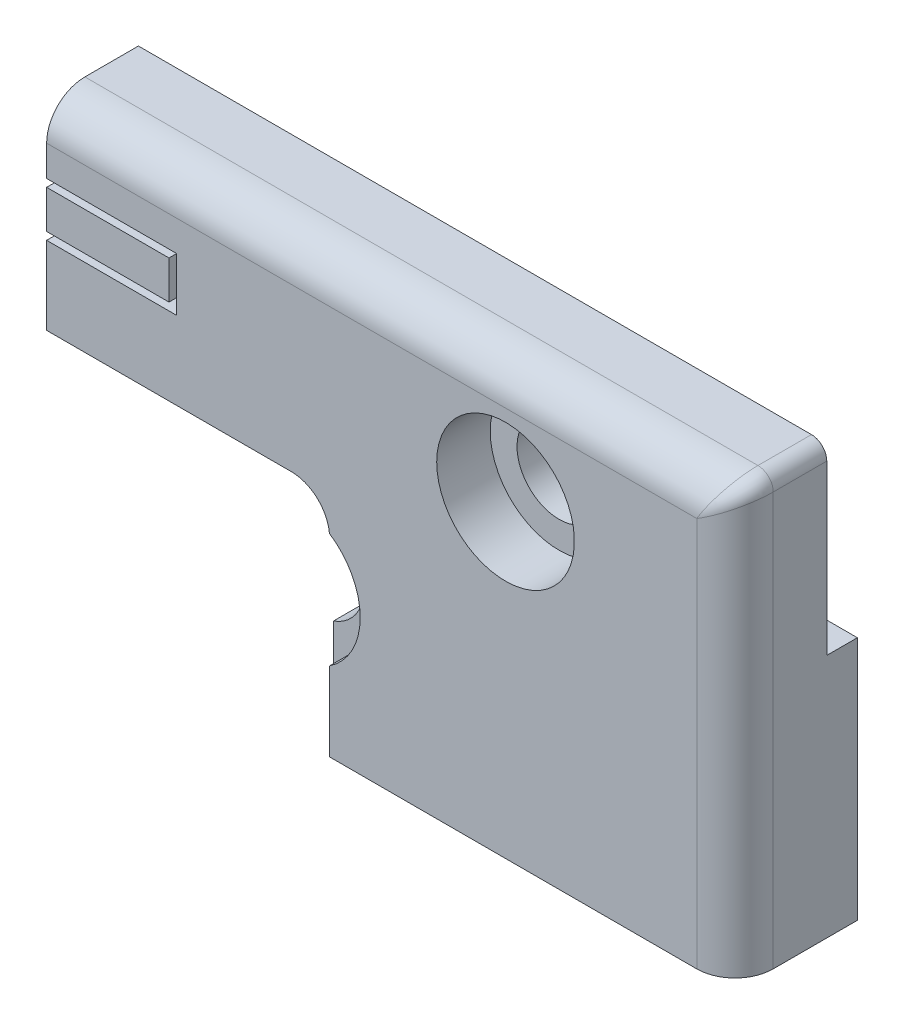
ISO-10303-21;
HEADER;
FILE_DESCRIPTION(('STEP AP214'),'2;1');
FILE_NAME('part.step','',(''),(''),'','','');
FILE_SCHEMA(('AUTOMOTIVE_DESIGN { 1 0 10303 214 1 1 1 1 }'));
ENDSEC;
DATA;
#1=APPLICATION_CONTEXT('core data for automotive mechanical design processes');
#2=APPLICATION_PROTOCOL_DEFINITION('international standard','automotive_design',2000,#1);
#3=PRODUCT_CONTEXT('',#1,'mechanical');
#4=PRODUCT('Part','Part','',(#3));
#5=PRODUCT_RELATED_PRODUCT_CATEGORY('part','',(#4));
#6=PRODUCT_DEFINITION_FORMATION('','',#4);
#7=PRODUCT_DEFINITION_CONTEXT('part definition',#1,'design');
#8=PRODUCT_DEFINITION('design','',#6,#7);
#9=PRODUCT_DEFINITION_SHAPE('','',#8);
#10=(LENGTH_UNIT() NAMED_UNIT(*) SI_UNIT(.MILLI.,.METRE.));
#11=(NAMED_UNIT(*) PLANE_ANGLE_UNIT() SI_UNIT($,.RADIAN.));
#12=(NAMED_UNIT(*) SI_UNIT($,.STERADIAN.) SOLID_ANGLE_UNIT());
#13=UNCERTAINTY_MEASURE_WITH_UNIT(LENGTH_MEASURE(1.E-05),#10,'distance_accuracy_value','');
#14=(GEOMETRIC_REPRESENTATION_CONTEXT(3) GLOBAL_UNCERTAINTY_ASSIGNED_CONTEXT((#13)) GLOBAL_UNIT_ASSIGNED_CONTEXT((#10,
#11,#12)) REPRESENTATION_CONTEXT('',''));
#15=CARTESIAN_POINT('',(0.,0.,0.));
#16=DIRECTION('',(0.,0.,1.));
#17=DIRECTION('',(1.,0.,0.));
#18=AXIS2_PLACEMENT_3D('',#15,#16,#17);
#19=CARTESIAN_POINT('',(0.,-30.0864940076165,2.));
#20=DIRECTION('',(0.,0.,-1.));
#21=DIRECTION('',(0.,1.,0.));
#22=AXIS2_PLACEMENT_3D('',#19,#20,#21);
#23=PLANE('',#22);
#24=DIRECTION('',(-1.,0.,0.));
#25=VECTOR('',#24,1.);
#26=CARTESIAN_POINT('',(0.,-5.75000000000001,2.));
#27=LINE('',#26,#25);
#28=CARTESIAN_POINT('',(10.2088987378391,-5.75000000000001,2.));
#29=VERTEX_POINT('',#28);
#30=CARTESIAN_POINT('',(0.,-5.75000000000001,2.));
#31=VERTEX_POINT('',#30);
#32=EDGE_CURVE('E645',#29,#31,#27,.T.);
#33=ORIENTED_EDGE('',*,*,#32,.T.);
#34=DIRECTION('',(0.,1.,0.));
#35=VECTOR('',#34,1.);
#36=CARTESIAN_POINT('',(0.,-30.0864940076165,2.));
#37=LINE('',#36,#35);
#38=CARTESIAN_POINT('',(0.,-1.74999999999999,2.));
#39=VERTEX_POINT('',#38);
#40=EDGE_CURVE('E47',#31,#39,#37,.T.);
#41=ORIENTED_EDGE('',*,*,#40,.T.);
#42=DIRECTION('',(1.,0.,0.));
#43=VECTOR('',#42,1.);
#44=CARTESIAN_POINT('',(-8.5,-1.75,2.));
#45=LINE('',#44,#43);
#46=CARTESIAN_POINT('',(7.16561914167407,-1.74999999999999,2.));
#47=VERTEX_POINT('',#46);
#48=EDGE_CURVE('E415',#39,#47,#45,.T.);
#49=ORIENTED_EDGE('',*,*,#48,.T.);
#50=CARTESIAN_POINT('',(7.16561914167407,-2.74999999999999,2.));
#51=DIRECTION('',(0.,0.,-1.));
#52=DIRECTION('',(0.,1.,0.));
#53=AXIS2_PLACEMENT_3D('',#50,#51,#52);
#54=CIRCLE('',#53,1.);
#55=CARTESIAN_POINT('',(8.13801595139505,-2.51666666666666,2.));
#56=VERTEX_POINT('',#55);
#57=EDGE_CURVE('E676',#47,#56,#54,.T.);
#58=ORIENTED_EDGE('',*,*,#57,.T.);
#59=CARTESIAN_POINT('',(13.,-1.35000000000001,2.));
#60=DIRECTION('',(0.,0.,-1.));
#61=DIRECTION('',(0.,1.,0.));
#62=AXIS2_PLACEMENT_3D('',#59,#60,#61);
#63=CIRCLE('',#62,5.);
#64=CARTESIAN_POINT('',(9.875,-5.25312374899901,2.));
#65=VERTEX_POINT('',#64);
#66=EDGE_CURVE('E709',#65,#56,#63,.T.);
#67=ORIENTED_EDGE('',*,*,#66,.F.);
#68=CARTESIAN_POINT('',(9.25,-6.03374849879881,2.));
#69=DIRECTION('',(0.,0.,-1.));
#70=DIRECTION('',(0.,1.,0.));
#71=AXIS2_PLACEMENT_3D('',#68,#69,#70);
#72=CIRCLE('',#71,1.);
#73=EDGE_CURVE('E678',#65,#29,#72,.T.);
#74=ORIENTED_EDGE('',*,*,#73,.T.);
#75=EDGE_LOOP('',(#33,#41,#49,#58,#67,#74));
#76=FACE_BOUND('',#75,.T.);
#77=ADVANCED_FACE('F32',(#76),#23,.T.);
#78=CARTESIAN_POINT('',(-16.,-9.35000000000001,0.));
#79=DIRECTION('',(0.,0.,1.));
#80=DIRECTION('',(1.,0.,0.));
#81=AXIS2_PLACEMENT_3D('',#78,#79,#80);
#82=PLANE('',#81);
#83=DIRECTION('',(0.,-1.,0.));
#84=VECTOR('',#83,1.);
#85=CARTESIAN_POINT('',(0.,-9.35000000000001,0.));
#86=LINE('',#85,#84);
#87=CARTESIAN_POINT('',(0.,-5.75000000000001,0.));
#88=VERTEX_POINT('',#87);
#89=CARTESIAN_POINT('',(0.,-6.85,0.));
#90=VERTEX_POINT('',#89);
#91=EDGE_CURVE('E878',#88,#90,#86,.T.);
#92=ORIENTED_EDGE('',*,*,#91,.F.);
#93=DIRECTION('',(-1.,0.,0.));
#94=VECTOR('',#93,1.);
#95=CARTESIAN_POINT('',(0.,-5.75000000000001,0.));
#96=LINE('',#95,#94);
#97=CARTESIAN_POINT('',(10.2088987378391,-5.75000000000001,0.));
#98=VERTEX_POINT('',#97);
#99=EDGE_CURVE('E404',#98,#88,#96,.T.);
#100=ORIENTED_EDGE('',*,*,#99,.F.);
#101=CARTESIAN_POINT('',(9.25,-6.03374849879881,0.));
#102=DIRECTION('',(0.,0.,1.));
#103=DIRECTION('',(1.,0.,0.));
#104=AXIS2_PLACEMENT_3D('',#101,#102,#103);
#105=CIRCLE('',#104,1.);
#106=CARTESIAN_POINT('',(10.25,-6.03374849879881,0.));
#107=VERTEX_POINT('',#106);
#108=EDGE_CURVE('E682',#98,#107,#105,.F.);
#109=ORIENTED_EDGE('',*,*,#108,.T.);
#110=DIRECTION('',(0.,-1.,0.));
#111=VECTOR('',#110,1.);
#112=CARTESIAN_POINT('',(10.25,-9.35000000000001,0.));
#113=LINE('',#112,#111);
#114=CARTESIAN_POINT('',(10.25,-6.85000000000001,0.));
#115=VERTEX_POINT('',#114);
#116=EDGE_CURVE('E716',#107,#115,#113,.T.);
#117=ORIENTED_EDGE('',*,*,#116,.T.);
#118=DIRECTION('',(1.,0.,0.));
#119=VECTOR('',#118,1.);
#120=CARTESIAN_POINT('',(0.,-6.85,0.));
#121=LINE('',#120,#119);
#122=EDGE_CURVE('E422',#90,#115,#121,.T.);
#123=ORIENTED_EDGE('',*,*,#122,.F.);
#124=EDGE_LOOP('',(#92,#100,#109,#117,#123));
#125=FACE_BOUND('',#124,.T.);
#126=ADVANCED_FACE('F492',(#125),#82,.F.);
#127=CARTESIAN_POINT('',(-16.,-9.35000000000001,8.));
#128=DIRECTION('',(0.,0.,1.));
#129=DIRECTION('',(1.,0.,0.));
#130=AXIS2_PLACEMENT_3D('',#127,#128,#129);
#131=PLANE('',#130);
#132=CARTESIAN_POINT('',(30.,-1.55,8.));
#133=DIRECTION('',(0.,0.,-1.));
#134=DIRECTION('',(-1.,0.,0.));
#135=AXIS2_PLACEMENT_3D('',#132,#133,#134);
#136=CIRCLE('',#135,4.5);
#137=CARTESIAN_POINT('',(25.5,-1.55,8.));
#138=VERTEX_POINT('',#137);
#139=EDGE_CURVE('E523',#138,#138,#136,.T.);
#140=ORIENTED_EDGE('',*,*,#139,.T.);
#141=EDGE_LOOP('',(#140));
#142=FACE_BOUND('',#141,.T.);
#143=DIRECTION('',(1.,0.,0.));
#144=VECTOR('',#143,1.);
#145=CARTESIAN_POINT('',(0.,3.75,8.));
#146=LINE('',#145,#144);
#147=CARTESIAN_POINT('',(42.5,3.75,8.));
#148=VERTEX_POINT('',#147);
#149=CARTESIAN_POINT('',(0.,3.75,8.));
#150=VERTEX_POINT('',#149);
#151=EDGE_CURVE('E436',#148,#150,#146,.F.);
#152=ORIENTED_EDGE('',*,*,#151,.T.);
#153=DIRECTION('',(0.,-1.,0.));
#154=VECTOR('',#153,1.);
#155=CARTESIAN_POINT('',(0.,-9.35000000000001,8.));
#156=LINE('',#155,#154);
#157=CARTESIAN_POINT('',(0.,1.75,8.));
#158=VERTEX_POINT('',#157);
#159=EDGE_CURVE('E388',#150,#158,#156,.T.);
#160=ORIENTED_EDGE('',*,*,#159,.T.);
#161=DIRECTION('',(1.,0.,0.));
#162=VECTOR('',#161,1.);
#163=CARTESIAN_POINT('',(0.,1.75,8.));
#164=LINE('',#163,#162);
#165=CARTESIAN_POINT('',(8.5,1.75,8.));
#166=VERTEX_POINT('',#165);
#167=EDGE_CURVE('E425',#158,#166,#164,.T.);
#168=ORIENTED_EDGE('',*,*,#167,.T.);
#169=DIRECTION('',(0.,1.,0.));
#170=VECTOR('',#169,1.);
#171=CARTESIAN_POINT('',(8.5,1.75,8.));
#172=LINE('',#171,#170);
#173=CARTESIAN_POINT('',(8.5,-1.75,8.));
#174=VERTEX_POINT('',#173);
#175=EDGE_CURVE('E593',#174,#166,#172,.T.);
#176=ORIENTED_EDGE('',*,*,#175,.F.);
#177=DIRECTION('',(-1.,0.,0.));
#178=VECTOR('',#177,1.);
#179=CARTESIAN_POINT('',(-8.5,-1.75,8.));
#180=LINE('',#179,#178);
#181=CARTESIAN_POINT('',(0.,-1.75,8.));
#182=VERTEX_POINT('',#181);
#183=EDGE_CURVE('E421',#174,#182,#180,.T.);
#184=ORIENTED_EDGE('',*,*,#183,.T.);
#185=CARTESIAN_POINT('',(0.,-6.85,8.));
#186=VERTEX_POINT('',#185);
#187=EDGE_CURVE('E867',#182,#186,#156,.T.);
#188=ORIENTED_EDGE('',*,*,#187,.T.);
#189=DIRECTION('',(1.,0.,0.));
#190=VECTOR('',#189,1.);
#191=CARTESIAN_POINT('',(0.,-6.85,8.));
#192=LINE('',#191,#190);
#193=CARTESIAN_POINT('',(16.,-6.85,8.));
#194=VERTEX_POINT('',#193);
#195=EDGE_CURVE('E419',#186,#194,#192,.T.);
#196=ORIENTED_EDGE('',*,*,#195,.T.);
#197=CARTESIAN_POINT('',(16.,-9.35000000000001,8.));
#198=DIRECTION('',(0.,0.,1.));
#199=DIRECTION('',(-1.,0.,0.));
#200=AXIS2_PLACEMENT_3D('',#197,#198,#199);
#201=CIRCLE('',#200,2.5);
#202=CARTESIAN_POINT('',(18.4874685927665,-9.1,8.));
#203=VERTEX_POINT('',#202);
#204=EDGE_CURVE('E597',#203,#194,#201,.T.);
#205=ORIENTED_EDGE('',*,*,#204,.F.);
#206=CARTESIAN_POINT('',(16.,-12.85,8.));
#207=DIRECTION('',(0.,0.,-1.));
#208=DIRECTION('',(-1.,0.,0.));
#209=AXIS2_PLACEMENT_3D('',#206,#207,#208);
#210=CIRCLE('',#209,4.5);
#211=CARTESIAN_POINT('',(18.5,-16.5916573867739,8.));
#212=VERTEX_POINT('',#211);
#213=EDGE_CURVE('E560',#203,#212,#210,.T.);
#214=ORIENTED_EDGE('',*,*,#213,.T.);
#215=DIRECTION('',(0.,1.,0.));
#216=VECTOR('',#215,1.);
#217=CARTESIAN_POINT('',(18.5,-18.85,8.));
#218=LINE('',#217,#216);
#219=CARTESIAN_POINT('',(18.5,-21.75,8.));
#220=VERTEX_POINT('',#219);
#221=EDGE_CURVE('E600',#220,#212,#218,.T.);
#222=ORIENTED_EDGE('',*,*,#221,.F.);
#223=DIRECTION('',(-1.,0.,0.));
#224=VECTOR('',#223,1.);
#225=CARTESIAN_POINT('',(18.5,-21.75,8.));
#226=LINE('',#225,#224);
#227=CARTESIAN_POINT('',(42.5,-21.75,8.));
#228=VERTEX_POINT('',#227);
#229=EDGE_CURVE('E591',#228,#220,#226,.T.);
#230=ORIENTED_EDGE('',*,*,#229,.F.);
#231=DIRECTION('',(0.,-1.,0.));
#232=VECTOR('',#231,1.);
#233=CARTESIAN_POINT('',(42.5,-9.35000000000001,8.));
#234=LINE('',#233,#232);
#235=EDGE_CURVE('E434',#228,#148,#234,.F.);
#236=ORIENTED_EDGE('',*,*,#235,.T.);
#237=EDGE_LOOP('',(#152,#160,#168,#176,#184,#188,#196,#205,#214,#222,#230,#236));
#238=FACE_BOUND('',#237,.T.);
#239=ADVANCED_FACE('F498',(#142,#238),#131,.T.);
#240=CARTESIAN_POINT('',(-8.5,-1.75,8.));
#241=DIRECTION('',(0.,-1.,0.));
#242=DIRECTION('',(1.,0.,0.));
#243=AXIS2_PLACEMENT_3D('',#240,#241,#242);
#244=PLANE('',#243);
#245=DIRECTION('',(0.,0.,1.));
#246=VECTOR('',#245,1.);
#247=CARTESIAN_POINT('',(7.,-1.75,6.6));
#248=LINE('',#247,#246);
#249=CARTESIAN_POINT('',(7.0000000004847,-1.74999999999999,6.1));
#250=VERTEX_POINT('',#249);
#251=CARTESIAN_POINT('',(7.,-1.75,6.6));
#252=VERTEX_POINT('',#251);
#253=EDGE_CURVE('E769',#250,#252,#248,.T.);
#254=ORIENTED_EDGE('',*,*,#253,.T.);
#255=DIRECTION('',(-1.,0.,0.));
#256=VECTOR('',#255,1.);
#257=CARTESIAN_POINT('',(7.,-1.75,6.6));
#258=LINE('',#257,#256);
#259=CARTESIAN_POINT('',(6.,-1.75,6.6));
#260=VERTEX_POINT('',#259);
#261=EDGE_CURVE('E778',#252,#260,#258,.T.);
#262=ORIENTED_EDGE('',*,*,#261,.T.);
#263=DIRECTION('',(0.,0.,-1.));
#264=VECTOR('',#263,1.);
#265=CARTESIAN_POINT('',(6.,-1.75,6.6));
#266=LINE('',#265,#264);
#267=CARTESIAN_POINT('',(6.,-1.75,6.1));
#268=VERTEX_POINT('',#267);
#269=EDGE_CURVE('E775',#260,#268,#266,.T.);
#270=ORIENTED_EDGE('',*,*,#269,.T.);
#271=DIRECTION('',(1.,0.,0.));
#272=VECTOR('',#271,1.);
#273=CARTESIAN_POINT('',(7.,-1.75,6.1));
#274=LINE('',#273,#272);
#275=EDGE_CURVE('E772',#268,#250,#274,.T.);
#276=ORIENTED_EDGE('',*,*,#275,.T.);
#277=EDGE_LOOP('',(#254,#262,#270,#276));
#278=FACE_BOUND('',#277,.T.);
#279=DIRECTION('',(0.,0.,1.));
#280=VECTOR('',#279,1.);
#281=CARTESIAN_POINT('',(3.5,-1.75,6.6));
#282=LINE('',#281,#280);
#283=CARTESIAN_POINT('',(3.50000000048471,-1.74999999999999,6.1));
#284=VERTEX_POINT('',#283);
#285=CARTESIAN_POINT('',(3.5,-1.75,6.6));
#286=VERTEX_POINT('',#285);
#287=EDGE_CURVE('E732',#284,#286,#282,.T.);
#288=ORIENTED_EDGE('',*,*,#287,.T.);
#289=DIRECTION('',(-1.,0.,0.));
#290=VECTOR('',#289,1.);
#291=CARTESIAN_POINT('',(3.5,-1.75,6.6));
#292=LINE('',#291,#290);
#293=CARTESIAN_POINT('',(2.5,-1.75,6.6));
#294=VERTEX_POINT('',#293);
#295=EDGE_CURVE('E742',#286,#294,#292,.T.);
#296=ORIENTED_EDGE('',*,*,#295,.T.);
#297=DIRECTION('',(0.,0.,-1.));
#298=VECTOR('',#297,1.);
#299=CARTESIAN_POINT('',(2.5,-1.75,6.6));
#300=LINE('',#299,#298);
#301=CARTESIAN_POINT('',(2.5,-1.75,6.1));
#302=VERTEX_POINT('',#301);
#303=EDGE_CURVE('E739',#294,#302,#300,.T.);
#304=ORIENTED_EDGE('',*,*,#303,.T.);
#305=DIRECTION('',(1.,0.,0.));
#306=VECTOR('',#305,1.);
#307=CARTESIAN_POINT('',(3.5,-1.75,6.1));
#308=LINE('',#307,#306);
#309=EDGE_CURVE('E736',#302,#284,#308,.T.);
#310=ORIENTED_EDGE('',*,*,#309,.T.);
#311=EDGE_LOOP('',(#288,#296,#304,#310));
#312=FACE_BOUND('',#311,.T.);
#313=DIRECTION('',(0.,0.,-1.));
#314=VECTOR('',#313,1.);
#315=CARTESIAN_POINT('',(0.,-1.75,8.));
#316=LINE('',#315,#314);
#317=EDGE_CURVE('E883',#182,#39,#316,.T.);
#318=ORIENTED_EDGE('',*,*,#317,.F.);
#319=ORIENTED_EDGE('',*,*,#183,.F.);
#320=DIRECTION('',(0.,0.,-1.));
#321=VECTOR('',#320,1.);
#322=CARTESIAN_POINT('',(8.5,-1.75,8.));
#323=LINE('',#322,#321);
#324=CARTESIAN_POINT('',(8.5,-1.75,5.8));
#325=VERTEX_POINT('',#324);
#326=EDGE_CURVE('E630',#174,#325,#323,.T.);
#327=ORIENTED_EDGE('',*,*,#326,.T.);
#328=DIRECTION('',(1.,0.,0.));
#329=VECTOR('',#328,1.);
#330=CARTESIAN_POINT('',(-8.5,-1.75,5.8));
#331=LINE('',#330,#329);
#332=CARTESIAN_POINT('',(7.16561914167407,-1.74999999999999,5.8));
#333=VERTEX_POINT('',#332);
#334=EDGE_CURVE('E695',#333,#325,#331,.T.);
#335=ORIENTED_EDGE('',*,*,#334,.F.);
#336=DIRECTION('',(0.,0.,1.));
#337=VECTOR('',#336,1.);
#338=CARTESIAN_POINT('',(7.16561914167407,-1.74999999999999,8.));
#339=LINE('',#338,#337);
#340=EDGE_CURVE('E684',#333,#47,#339,.F.);
#341=ORIENTED_EDGE('',*,*,#340,.T.);
#342=ORIENTED_EDGE('',*,*,#48,.F.);
#343=EDGE_LOOP('',(#318,#319,#327,#335,#341,#342));
#344=FACE_BOUND('',#343,.T.);
#345=ADVANCED_FACE('F516',(#278,#312,#344),#244,.F.);
#346=CARTESIAN_POINT('',(0.,-6.85,8.));
#347=DIRECTION('',(0.,1.,0.));
#348=DIRECTION('',(-1.,0.,0.));
#349=AXIS2_PLACEMENT_3D('',#346,#347,#348);
#350=PLANE('',#349);
#351=DIRECTION('',(0.,0.,1.));
#352=VECTOR('',#351,1.);
#353=CARTESIAN_POINT('',(0.,-6.85,8.));
#354=LINE('',#353,#352);
#355=EDGE_CURVE('E881',#90,#186,#354,.T.);
#356=ORIENTED_EDGE('',*,*,#355,.F.);
#357=ORIENTED_EDGE('',*,*,#122,.T.);
#358=DIRECTION('',(0.,0.,1.));
#359=VECTOR('',#358,1.);
#360=CARTESIAN_POINT('',(10.25,-6.85000000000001,-1.5));
#361=LINE('',#360,#359);
#362=CARTESIAN_POINT('',(10.25,-6.85000000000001,5.8));
#363=VERTEX_POINT('',#362);
#364=EDGE_CURVE('E711',#115,#363,#361,.T.);
#365=ORIENTED_EDGE('',*,*,#364,.T.);
#366=DIRECTION('',(1.,0.,0.));
#367=VECTOR('',#366,1.);
#368=CARTESIAN_POINT('',(15.75,-6.85,5.8));
#369=LINE('',#368,#367);
#370=CARTESIAN_POINT('',(15.75,-6.85,5.8));
#371=VERTEX_POINT('',#370);
#372=EDGE_CURVE('E823',#363,#371,#369,.T.);
#373=ORIENTED_EDGE('',*,*,#372,.T.);
#374=DIRECTION('',(0.,0.,1.));
#375=VECTOR('',#374,1.);
#376=CARTESIAN_POINT('',(15.75,-6.85,-1.5));
#377=LINE('',#376,#375);
#378=CARTESIAN_POINT('',(15.75,-6.85,0.));
#379=VERTEX_POINT('',#378);
#380=EDGE_CURVE('E706',#379,#371,#377,.T.);
#381=ORIENTED_EDGE('',*,*,#380,.F.);
#382=CARTESIAN_POINT('',(16.,-6.85,0.));
#383=VERTEX_POINT('',#382);
#384=EDGE_CURVE('E418',#379,#383,#121,.T.);
#385=ORIENTED_EDGE('',*,*,#384,.T.);
#386=DIRECTION('',(0.,0.,-1.));
#387=VECTOR('',#386,1.);
#388=CARTESIAN_POINT('',(16.,-6.85,8.));
#389=LINE('',#388,#387);
#390=EDGE_CURVE('E627',#194,#383,#389,.T.);
#391=ORIENTED_EDGE('',*,*,#390,.F.);
#392=ORIENTED_EDGE('',*,*,#195,.F.);
#393=EDGE_LOOP('',(#356,#357,#365,#373,#381,#385,#391,#392));
#394=FACE_BOUND('',#393,.T.);
#395=ADVANCED_FACE('F507',(#394),#350,.F.);
#396=CARTESIAN_POINT('',(30.,-1.55,2.));
#397=DIRECTION('',(0.,0.,1.));
#398=DIRECTION('',(0.,-1.,0.));
#399=AXIS2_PLACEMENT_3D('',#396,#397,#398);
#400=CIRCLE('',#399,2.75);
#401=CARTESIAN_POINT('',(30.,-4.3,2.));
#402=VERTEX_POINT('',#401);
#403=EDGE_CURVE('E521',#402,#402,#400,.F.);
#404=ORIENTED_EDGE('',*,*,#403,.F.);
#405=EDGE_LOOP('',(#404));
#406=FACE_BOUND('',#405,.T.);
#407=DIRECTION('',(-1.,0.,0.));
#408=VECTOR('',#407,1.);
#409=CARTESIAN_POINT('',(0.,1.75,2.));
#410=LINE('',#409,#408);
#411=CARTESIAN_POINT('',(8.5,1.75,2.));
#412=VERTEX_POINT('',#411);
#413=CARTESIAN_POINT('',(0.,1.75,2.));
#414=VERTEX_POINT('',#413);
#415=EDGE_CURVE('E396',#412,#414,#410,.T.);
#416=ORIENTED_EDGE('',*,*,#415,.T.);
#417=DIRECTION('',(0.,1.,0.));
#418=VECTOR('',#417,1.);
#419=CARTESIAN_POINT('',(0.,-30.0864940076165,2.));
#420=LINE('',#419,#418);
#421=CARTESIAN_POINT('',(0.,6.25,2.));
#422=VERTEX_POINT('',#421);
#423=EDGE_CURVE('E380',#414,#422,#420,.T.);
#424=ORIENTED_EDGE('',*,*,#423,.T.);
#425=DIRECTION('',(-1.,0.,0.));
#426=VECTOR('',#425,1.);
#427=CARTESIAN_POINT('',(0.,6.24999999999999,2.));
#428=LINE('',#427,#426);
#429=CARTESIAN_POINT('',(44.,6.25,2.));
#430=VERTEX_POINT('',#429);
#431=EDGE_CURVE('E393',#430,#422,#428,.T.);
#432=ORIENTED_EDGE('',*,*,#431,.F.);
#433=CARTESIAN_POINT('',(44.,5.25,2.));
#434=DIRECTION('',(0.,0.,1.));
#435=DIRECTION('',(0.,-1.,0.));
#436=AXIS2_PLACEMENT_3D('',#433,#434,#435);
#437=CIRCLE('',#436,1.);
#438=CARTESIAN_POINT('',(45.,5.25,2.));
#439=VERTEX_POINT('',#438);
#440=EDGE_CURVE('E446',#430,#439,#437,.F.);
#441=ORIENTED_EDGE('',*,*,#440,.T.);
#442=DIRECTION('',(0.,-1.,0.));
#443=VECTOR('',#442,1.);
#444=CARTESIAN_POINT('',(45.,-30.0864940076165,2.));
#445=LINE('',#444,#443);
#446=CARTESIAN_POINT('',(45.,-5.75000000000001,2.));
#447=VERTEX_POINT('',#446);
#448=EDGE_CURVE('E530',#439,#447,#445,.T.);
#449=ORIENTED_EDGE('',*,*,#448,.T.);
#450=CARTESIAN_POINT('',(15.7911012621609,-5.75000000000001,2.));
#451=VERTEX_POINT('',#450);
#452=EDGE_CURVE('E416',#447,#451,#27,.T.);
#453=ORIENTED_EDGE('',*,*,#452,.T.);
#454=CARTESIAN_POINT('',(16.75,-6.0337484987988,2.));
#455=DIRECTION('',(0.,0.,-1.));
#456=DIRECTION('',(0.,1.,0.));
#457=AXIS2_PLACEMENT_3D('',#454,#455,#456);
#458=CIRCLE('',#457,1.);
#459=CARTESIAN_POINT('',(16.125,-5.25312374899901,2.));
#460=VERTEX_POINT('',#459);
#461=EDGE_CURVE('E660',#451,#460,#458,.T.);
#462=ORIENTED_EDGE('',*,*,#461,.T.);
#463=CARTESIAN_POINT('',(9.34444904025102,2.06129699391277,2.));
#464=VERTEX_POINT('',#463);
#465=EDGE_CURVE('E705',#464,#460,#63,.T.);
#466=ORIENTED_EDGE('',*,*,#465,.F.);
#467=CARTESIAN_POINT('',(8.61333884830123,2.74355639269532,2.));
#468=DIRECTION('',(0.,0.,-1.));
#469=DIRECTION('',(0.,1.,0.));
#470=AXIS2_PLACEMENT_3D('',#467,#468,#469);
#471=CIRCLE('',#470,1.);
#472=EDGE_CURVE('E661',#464,#412,#471,.T.);
#473=ORIENTED_EDGE('',*,*,#472,.T.);
#474=EDGE_LOOP('',(#416,#424,#432,#441,#449,#453,#462,#466,#473));
#475=FACE_BOUND('',#474,.T.);
#476=ADVANCED_FACE('F392',(#406,#475),#23,.T.);
#477=CARTESIAN_POINT('',(0.,-5.75000000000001,2.75));
#478=DIRECTION('',(0.,-1.,0.));
#479=DIRECTION('',(0.,0.,-1.));
#480=AXIS2_PLACEMENT_3D('',#477,#478,#479);
#481=PLANE('',#480);
#482=DIRECTION('',(0.,0.,-1.));
#483=VECTOR('',#482,1.);
#484=CARTESIAN_POINT('',(0.,-5.75000000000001,2.75));
#485=LINE('',#484,#483);
#486=EDGE_CURVE('E876',#31,#88,#485,.T.);
#487=ORIENTED_EDGE('',*,*,#486,.F.);
#488=ORIENTED_EDGE('',*,*,#32,.F.);
#489=DIRECTION('',(0.,0.,1.));
#490=VECTOR('',#489,1.);
#491=CARTESIAN_POINT('',(10.2088987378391,-5.75000000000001,2.));
#492=LINE('',#491,#490);
#493=EDGE_CURVE('E680',#29,#98,#492,.F.);
#494=ORIENTED_EDGE('',*,*,#493,.T.);
#495=ORIENTED_EDGE('',*,*,#99,.T.);
#496=EDGE_LOOP('',(#487,#488,#494,#495));
#497=FACE_BOUND('',#496,.T.);
#498=ADVANCED_FACE('F506',(#497),#481,.F.);
#499=CARTESIAN_POINT('',(0.,1.75,8.));
#500=DIRECTION('',(0.,1.,0.));
#501=DIRECTION('',(0.,0.,1.));
#502=AXIS2_PLACEMENT_3D('',#499,#500,#501);
#503=PLANE('',#502);
#504=DIRECTION('',(0.,0.,-1.));
#505=VECTOR('',#504,1.);
#506=CARTESIAN_POINT('',(6.,1.75000000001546,6.6));
#507=LINE('',#506,#505);
#508=CARTESIAN_POINT('',(6.,1.75000000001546,6.6));
#509=VERTEX_POINT('',#508);
#510=CARTESIAN_POINT('',(6.,1.75,6.1));
#511=VERTEX_POINT('',#510);
#512=EDGE_CURVE('E763',#509,#511,#507,.T.);
#513=ORIENTED_EDGE('',*,*,#512,.F.);
#514=DIRECTION('',(-1.,0.,0.));
#515=VECTOR('',#514,1.);
#516=CARTESIAN_POINT('',(7.0000000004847,1.75000000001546,6.6));
#517=LINE('',#516,#515);
#518=CARTESIAN_POINT('',(7.,1.75000000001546,6.6));
#519=VERTEX_POINT('',#518);
#520=EDGE_CURVE('E766',#519,#509,#517,.T.);
#521=ORIENTED_EDGE('',*,*,#520,.F.);
#522=DIRECTION('',(0.,0.,1.));
#523=VECTOR('',#522,1.);
#524=CARTESIAN_POINT('',(7.,1.75000000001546,6.6));
#525=LINE('',#524,#523);
#526=CARTESIAN_POINT('',(7.,1.75000000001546,6.1));
#527=VERTEX_POINT('',#526);
#528=EDGE_CURVE('E735',#527,#519,#525,.T.);
#529=ORIENTED_EDGE('',*,*,#528,.F.);
#530=DIRECTION('',(1.,0.,0.));
#531=VECTOR('',#530,1.);
#532=CARTESIAN_POINT('',(7.0000000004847,1.75000000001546,6.1));
#533=LINE('',#532,#531);
#534=EDGE_CURVE('E761',#511,#527,#533,.T.);
#535=ORIENTED_EDGE('',*,*,#534,.F.);
#536=EDGE_LOOP('',(#513,#521,#529,#535));
#537=FACE_BOUND('',#536,.T.);
#538=DIRECTION('',(0.,0.,-1.));
#539=VECTOR('',#538,1.);
#540=CARTESIAN_POINT('',(2.5,1.75000000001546,6.6));
#541=LINE('',#540,#539);
#542=CARTESIAN_POINT('',(2.5,1.75000000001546,6.6));
#543=VERTEX_POINT('',#542);
#544=CARTESIAN_POINT('',(2.5,1.75,6.1));
#545=VERTEX_POINT('',#544);
#546=EDGE_CURVE('E726',#543,#545,#541,.T.);
#547=ORIENTED_EDGE('',*,*,#546,.F.);
#548=DIRECTION('',(-1.,0.,0.));
#549=VECTOR('',#548,1.);
#550=CARTESIAN_POINT('',(3.5000000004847,1.75000000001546,6.6));
#551=LINE('',#550,#549);
#552=CARTESIAN_POINT('',(3.5,1.75000000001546,6.6));
#553=VERTEX_POINT('',#552);
#554=EDGE_CURVE('E729',#553,#543,#551,.T.);
#555=ORIENTED_EDGE('',*,*,#554,.F.);
#556=DIRECTION('',(0.,0.,1.));
#557=VECTOR('',#556,1.);
#558=CARTESIAN_POINT('',(3.5,1.75000000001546,6.6));
#559=LINE('',#558,#557);
#560=CARTESIAN_POINT('',(3.5,1.75000000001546,6.1));
#561=VERTEX_POINT('',#560);
#562=EDGE_CURVE('E722',#561,#553,#559,.T.);
#563=ORIENTED_EDGE('',*,*,#562,.F.);
#564=DIRECTION('',(1.,0.,0.));
#565=VECTOR('',#564,1.);
#566=CARTESIAN_POINT('',(3.5000000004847,1.75000000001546,6.1));
#567=LINE('',#566,#565);
#568=EDGE_CURVE('E724',#545,#561,#567,.T.);
#569=ORIENTED_EDGE('',*,*,#568,.F.);
#570=EDGE_LOOP('',(#547,#555,#563,#569));
#571=FACE_BOUND('',#570,.T.);
#572=DIRECTION('',(0.,0.,1.));
#573=VECTOR('',#572,1.);
#574=CARTESIAN_POINT('',(0.,1.75,8.));
#575=LINE('',#574,#573);
#576=EDGE_CURVE('E398',#414,#158,#575,.T.);
#577=ORIENTED_EDGE('',*,*,#576,.F.);
#578=ORIENTED_EDGE('',*,*,#415,.F.);
#579=DIRECTION('',(0.,0.,-1.));
#580=VECTOR('',#579,1.);
#581=CARTESIAN_POINT('',(8.5,1.75,8.));
#582=LINE('',#581,#580);
#583=CARTESIAN_POINT('',(8.5,1.75,5.8));
#584=VERTEX_POINT('',#583);
#585=EDGE_CURVE('E633',#584,#412,#582,.T.);
#586=ORIENTED_EDGE('',*,*,#585,.F.);
#587=EDGE_CURVE('E634',#166,#584,#582,.T.);
#588=ORIENTED_EDGE('',*,*,#587,.F.);
#589=ORIENTED_EDGE('',*,*,#167,.F.);
#590=EDGE_LOOP('',(#577,#578,#586,#588,#589));
#591=FACE_BOUND('',#590,.T.);
#592=ADVANCED_FACE('F513',(#537,#571,#591),#503,.F.);
#593=CARTESIAN_POINT('',(-45.,6.25,8.));
#594=DIRECTION('',(0.,-1.,0.));
#595=DIRECTION('',(1.,0.,0.));
#596=AXIS2_PLACEMENT_3D('',#593,#594,#595);
#597=PLANE('',#596);
#598=DIRECTION('',(0.,0.,1.));
#599=VECTOR('',#598,1.);
#600=CARTESIAN_POINT('',(0.,6.25,-12.9306053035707));
#601=LINE('',#600,#599);
#602=CARTESIAN_POINT('',(0.,6.25,5.5));
#603=VERTEX_POINT('',#602);
#604=EDGE_CURVE('E377',#422,#603,#601,.T.);
#605=ORIENTED_EDGE('',*,*,#604,.T.);
#606=DIRECTION('',(1.,0.,0.));
#607=VECTOR('',#606,1.);
#608=CARTESIAN_POINT('',(44.,6.25,5.5));
#609=LINE('',#608,#607);
#610=CARTESIAN_POINT('',(44.,6.25,5.5));
#611=VERTEX_POINT('',#610);
#612=EDGE_CURVE('E432',#603,#611,#609,.T.);
#613=ORIENTED_EDGE('',*,*,#612,.T.);
#614=DIRECTION('',(0.,0.,-1.));
#615=VECTOR('',#614,1.);
#616=CARTESIAN_POINT('',(44.,6.25,0.));
#617=LINE('',#616,#615);
#618=EDGE_CURVE('E403',#611,#430,#617,.T.);
#619=ORIENTED_EDGE('',*,*,#618,.T.);
#620=ORIENTED_EDGE('',*,*,#431,.T.);
#621=EDGE_LOOP('',(#605,#613,#619,#620));
#622=FACE_BOUND('',#621,.T.);
#623=ADVANCED_FACE('F401',(#622),#597,.F.);
#624=CARTESIAN_POINT('',(-7.0000000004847,500000.,6.1));
#625=DIRECTION('',(0.,0.,1.));
#626=DIRECTION('',(1.,0.,0.));
#627=AXIS2_PLACEMENT_3D('',#624,#625,#626);
#628=PLANE('',#627);
#629=DIRECTION('',(0.,-1.,0.));
#630=VECTOR('',#629,1.);
#631=CARTESIAN_POINT('',(-1.92719104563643E-11,500000.,6.1));
#632=LINE('',#631,#630);
#633=CARTESIAN_POINT('',(0.,1.24999999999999,6.1));
#634=VERTEX_POINT('',#633);
#635=CARTESIAN_POINT('',(0.,-1.25,6.1));
#636=VERTEX_POINT('',#635);
#637=EDGE_CURVE('E874',#634,#636,#632,.T.);
#638=ORIENTED_EDGE('',*,*,#637,.F.);
#639=DIRECTION('',(1.,0.,0.));
#640=VECTOR('',#639,1.);
#641=CARTESIAN_POINT('',(-7.99999999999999,1.25,6.1));
#642=LINE('',#641,#640);
#643=CARTESIAN_POINT('',(2.5,1.25,6.1));
#644=VERTEX_POINT('',#643);
#645=EDGE_CURVE('E640',#634,#644,#642,.T.);
#646=ORIENTED_EDGE('',*,*,#645,.T.);
#647=DIRECTION('',(0.,-1.,0.));
#648=VECTOR('',#647,1.);
#649=CARTESIAN_POINT('',(2.5000000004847,500000.,6.1));
#650=LINE('',#649,#648);
#651=EDGE_CURVE('E750',#545,#644,#650,.T.);
#652=ORIENTED_EDGE('',*,*,#651,.F.);
#653=ORIENTED_EDGE('',*,*,#568,.T.);
#654=DIRECTION('',(0.,-1.,0.));
#655=VECTOR('',#654,1.);
#656=CARTESIAN_POINT('',(3.5000000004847,500000.,6.1));
#657=LINE('',#656,#655);
#658=CARTESIAN_POINT('',(3.5,1.25000000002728,6.1));
#659=VERTEX_POINT('',#658);
#660=EDGE_CURVE('E746',#561,#659,#657,.T.);
#661=ORIENTED_EDGE('',*,*,#660,.T.);
#662=DIRECTION('',(1.,0.,0.));
#663=VECTOR('',#662,1.);
#664=CARTESIAN_POINT('',(8.,1.25,6.1));
#665=LINE('',#664,#663);
#666=CARTESIAN_POINT('',(6.,1.25,6.1));
#667=VERTEX_POINT('',#666);
#668=EDGE_CURVE('E887',#659,#667,#665,.T.);
#669=ORIENTED_EDGE('',*,*,#668,.T.);
#670=DIRECTION('',(0.,-1.,0.));
#671=VECTOR('',#670,1.);
#672=CARTESIAN_POINT('',(6.0000000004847,500000.,6.1));
#673=LINE('',#672,#671);
#674=EDGE_CURVE('E786',#511,#667,#673,.T.);
#675=ORIENTED_EDGE('',*,*,#674,.F.);
#676=ORIENTED_EDGE('',*,*,#534,.T.);
#677=DIRECTION('',(0.,-1.,0.));
#678=VECTOR('',#677,1.);
#679=CARTESIAN_POINT('',(7.0000000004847,500000.,6.1));
#680=LINE('',#679,#678);
#681=CARTESIAN_POINT('',(7.,1.25000000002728,6.1));
#682=VERTEX_POINT('',#681);
#683=EDGE_CURVE('E782',#527,#682,#680,.T.);
#684=ORIENTED_EDGE('',*,*,#683,.T.);
#685=CARTESIAN_POINT('',(8.,1.25,6.1));
#686=VERTEX_POINT('',#685);
#687=EDGE_CURVE('E885',#682,#686,#665,.T.);
#688=ORIENTED_EDGE('',*,*,#687,.T.);
#689=DIRECTION('',(0.,-1.,0.));
#690=VECTOR('',#689,1.);
#691=CARTESIAN_POINT('',(8.,-1.25,6.1));
#692=LINE('',#691,#690);
#693=CARTESIAN_POINT('',(8.,-1.25,6.1));
#694=VERTEX_POINT('',#693);
#695=EDGE_CURVE('E892',#686,#694,#692,.T.);
#696=ORIENTED_EDGE('',*,*,#695,.T.);
#697=DIRECTION('',(-1.,0.,0.));
#698=VECTOR('',#697,1.);
#699=CARTESIAN_POINT('',(8.,-1.25,6.1));
#700=LINE('',#699,#698);
#701=CARTESIAN_POINT('',(7.,-1.25000000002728,6.1));
#702=VERTEX_POINT('',#701);
#703=EDGE_CURVE('E888',#694,#702,#700,.T.);
#704=ORIENTED_EDGE('',*,*,#703,.T.);
#705=EDGE_CURVE('E768',#702,#250,#680,.T.);
#706=ORIENTED_EDGE('',*,*,#705,.T.);
#707=ORIENTED_EDGE('',*,*,#275,.F.);
#708=CARTESIAN_POINT('',(6.,-1.25000000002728,6.1));
#709=VERTEX_POINT('',#708);
#710=EDGE_CURVE('E785',#709,#268,#673,.T.);
#711=ORIENTED_EDGE('',*,*,#710,.F.);
#712=CARTESIAN_POINT('',(3.5,-1.25000000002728,6.1));
#713=VERTEX_POINT('',#712);
#714=EDGE_CURVE('E891',#709,#713,#700,.T.);
#715=ORIENTED_EDGE('',*,*,#714,.T.);
#716=EDGE_CURVE('E731',#713,#284,#657,.T.);
#717=ORIENTED_EDGE('',*,*,#716,.T.);
#718=ORIENTED_EDGE('',*,*,#309,.F.);
#719=CARTESIAN_POINT('',(2.5,-1.25000000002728,6.1));
#720=VERTEX_POINT('',#719);
#721=EDGE_CURVE('E749',#720,#302,#650,.T.);
#722=ORIENTED_EDGE('',*,*,#721,.F.);
#723=DIRECTION('',(1.,0.,0.));
#724=VECTOR('',#723,1.);
#725=CARTESIAN_POINT('',(-7.99999999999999,-1.25,6.1));
#726=LINE('',#725,#724);
#727=EDGE_CURVE('E641',#636,#720,#726,.T.);
#728=ORIENTED_EDGE('',*,*,#727,.F.);
#729=EDGE_LOOP('',(#638,#646,#652,#653,#661,#669,#675,#676,#684,#688,#696,#704,#706,#707,#711,
#715,#717,#718,#722,#728));
#730=FACE_BOUND('',#729,.T.);
#731=ADVANCED_FACE('F954',(#730),#628,.F.);
#732=CARTESIAN_POINT('',(-7.99999999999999,1.25,8.));
#733=DIRECTION('',(0.,1.,0.));
#734=DIRECTION('',(0.,0.,1.));
#735=AXIS2_PLACEMENT_3D('',#732,#733,#734);
#736=PLANE('',#735);
#737=ORIENTED_EDGE('',*,*,#645,.F.);
#738=DIRECTION('',(0.,0.,1.));
#739=VECTOR('',#738,1.);
#740=CARTESIAN_POINT('',(0.,1.25,8.));
#741=LINE('',#740,#739);
#742=CARTESIAN_POINT('',(0.,1.25,8.));
#743=VERTEX_POINT('',#742);
#744=EDGE_CURVE('E871',#634,#743,#741,.T.);
#745=ORIENTED_EDGE('',*,*,#744,.T.);
#746=DIRECTION('',(1.,0.,0.));
#747=VECTOR('',#746,1.);
#748=CARTESIAN_POINT('',(-7.99999999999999,1.25,8.));
#749=LINE('',#748,#747);
#750=CARTESIAN_POINT('',(8.,1.25,8.));
#751=VERTEX_POINT('',#750);
#752=EDGE_CURVE('E410',#743,#751,#749,.T.);
#753=ORIENTED_EDGE('',*,*,#752,.T.);
#754=DIRECTION('',(0.,0.,-1.));
#755=VECTOR('',#754,1.);
#756=CARTESIAN_POINT('',(8.,1.25,16.3815273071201));
#757=LINE('',#756,#755);
#758=EDGE_CURVE('E899',#751,#686,#757,.T.);
#759=ORIENTED_EDGE('',*,*,#758,.T.);
#760=ORIENTED_EDGE('',*,*,#687,.F.);
#761=DIRECTION('',(0.,0.,1.));
#762=VECTOR('',#761,1.);
#763=CARTESIAN_POINT('',(7.,1.25000000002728,6.6));
#764=LINE('',#763,#762);
#765=CARTESIAN_POINT('',(7.,1.25000000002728,6.6));
#766=VERTEX_POINT('',#765);
#767=EDGE_CURVE('E918',#682,#766,#764,.T.);
#768=ORIENTED_EDGE('',*,*,#767,.T.);
#769=DIRECTION('',(-1.,0.,0.));
#770=VECTOR('',#769,1.);
#771=CARTESIAN_POINT('',(7.0000000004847,1.25000000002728,6.6));
#772=LINE('',#771,#770);
#773=CARTESIAN_POINT('',(6.,1.25000000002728,6.6));
#774=VERTEX_POINT('',#773);
#775=EDGE_CURVE('E915',#766,#774,#772,.T.);
#776=ORIENTED_EDGE('',*,*,#775,.T.);
#777=DIRECTION('',(0.,0.,-1.));
#778=VECTOR('',#777,1.);
#779=CARTESIAN_POINT('',(6.,1.25000000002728,6.6));
#780=LINE('',#779,#778);
#781=EDGE_CURVE('E912',#774,#667,#780,.T.);
#782=ORIENTED_EDGE('',*,*,#781,.T.);
#783=ORIENTED_EDGE('',*,*,#668,.F.);
#784=DIRECTION('',(0.,0.,1.));
#785=VECTOR('',#784,1.);
#786=CARTESIAN_POINT('',(3.5,1.25000000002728,6.6));
#787=LINE('',#786,#785);
#788=CARTESIAN_POINT('',(3.5,1.25000000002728,6.6));
#789=VERTEX_POINT('',#788);
#790=EDGE_CURVE('E909',#659,#789,#787,.T.);
#791=ORIENTED_EDGE('',*,*,#790,.T.);
#792=DIRECTION('',(-1.,0.,0.));
#793=VECTOR('',#792,1.);
#794=CARTESIAN_POINT('',(3.5000000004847,1.25000000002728,6.6));
#795=LINE('',#794,#793);
#796=CARTESIAN_POINT('',(2.5,1.25000000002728,6.6));
#797=VERTEX_POINT('',#796);
#798=EDGE_CURVE('E906',#789,#797,#795,.T.);
#799=ORIENTED_EDGE('',*,*,#798,.T.);
#800=DIRECTION('',(0.,0.,-1.));
#801=VECTOR('',#800,1.);
#802=CARTESIAN_POINT('',(2.5,1.25000000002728,6.6));
#803=LINE('',#802,#801);
#804=EDGE_CURVE('E903',#797,#644,#803,.T.);
#805=ORIENTED_EDGE('',*,*,#804,.T.);
#806=EDGE_LOOP('',(#737,#745,#753,#759,#760,#768,#776,#782,#783,#791,#799,#805));
#807=FACE_BOUND('',#806,.T.);
#808=ADVANCED_FACE('F967',(#807),#736,.T.);
#809=CARTESIAN_POINT('',(-7.99999999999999,-1.25,8.));
#810=DIRECTION('',(0.,1.,0.));
#811=DIRECTION('',(0.,0.,1.));
#812=AXIS2_PLACEMENT_3D('',#809,#810,#811);
#813=PLANE('',#812);
#814=DIRECTION('',(0.,0.,1.));
#815=VECTOR('',#814,1.);
#816=CARTESIAN_POINT('',(0.,-1.25,8.));
#817=LINE('',#816,#815);
#818=CARTESIAN_POINT('',(0.,-1.25,8.));
#819=VERTEX_POINT('',#818);
#820=EDGE_CURVE('E55',#636,#819,#817,.T.);
#821=ORIENTED_EDGE('',*,*,#820,.F.);
#822=ORIENTED_EDGE('',*,*,#727,.T.);
#823=DIRECTION('',(0.,0.,1.));
#824=VECTOR('',#823,1.);
#825=CARTESIAN_POINT('',(2.5,-1.25000000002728,6.6));
#826=LINE('',#825,#824);
#827=CARTESIAN_POINT('',(2.5,-1.25000000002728,6.6));
#828=VERTEX_POINT('',#827);
#829=EDGE_CURVE('E921',#720,#828,#826,.T.);
#830=ORIENTED_EDGE('',*,*,#829,.T.);
#831=DIRECTION('',(1.,0.,0.));
#832=VECTOR('',#831,1.);
#833=CARTESIAN_POINT('',(3.5000000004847,-1.25000000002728,6.6));
#834=LINE('',#833,#832);
#835=CARTESIAN_POINT('',(3.5,-1.25000000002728,6.6));
#836=VERTEX_POINT('',#835);
#837=EDGE_CURVE('E924',#828,#836,#834,.T.);
#838=ORIENTED_EDGE('',*,*,#837,.T.);
#839=DIRECTION('',(0.,0.,-1.));
#840=VECTOR('',#839,1.);
#841=CARTESIAN_POINT('',(3.5,-1.25000000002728,6.6));
#842=LINE('',#841,#840);
#843=EDGE_CURVE('E927',#836,#713,#842,.T.);
#844=ORIENTED_EDGE('',*,*,#843,.T.);
#845=ORIENTED_EDGE('',*,*,#714,.F.);
#846=DIRECTION('',(0.,0.,1.));
#847=VECTOR('',#846,1.);
#848=CARTESIAN_POINT('',(6.,-1.25000000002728,6.6));
#849=LINE('',#848,#847);
#850=CARTESIAN_POINT('',(6.,-1.25000000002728,6.6));
#851=VERTEX_POINT('',#850);
#852=EDGE_CURVE('E930',#709,#851,#849,.T.);
#853=ORIENTED_EDGE('',*,*,#852,.T.);
#854=DIRECTION('',(1.,0.,0.));
#855=VECTOR('',#854,1.);
#856=CARTESIAN_POINT('',(7.0000000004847,-1.25000000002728,6.6));
#857=LINE('',#856,#855);
#858=CARTESIAN_POINT('',(7.,-1.25000000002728,6.6));
#859=VERTEX_POINT('',#858);
#860=EDGE_CURVE('E836',#851,#859,#857,.T.);
#861=ORIENTED_EDGE('',*,*,#860,.T.);
#862=DIRECTION('',(0.,0.,-1.));
#863=VECTOR('',#862,1.);
#864=CARTESIAN_POINT('',(7.,-1.25000000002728,6.6));
#865=LINE('',#864,#863);
#866=EDGE_CURVE('E831',#859,#702,#865,.T.);
#867=ORIENTED_EDGE('',*,*,#866,.T.);
#868=ORIENTED_EDGE('',*,*,#703,.F.);
#869=DIRECTION('',(0.,0.,-1.));
#870=VECTOR('',#869,1.);
#871=CARTESIAN_POINT('',(8.,-1.25,16.3815273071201));
#872=LINE('',#871,#870);
#873=CARTESIAN_POINT('',(8.,-1.25,8.));
#874=VERTEX_POINT('',#873);
#875=EDGE_CURVE('E898',#874,#694,#872,.T.);
#876=ORIENTED_EDGE('',*,*,#875,.F.);
#877=DIRECTION('',(1.,0.,0.));
#878=VECTOR('',#877,1.);
#879=CARTESIAN_POINT('',(-7.99999999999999,-1.25,8.));
#880=LINE('',#879,#878);
#881=EDGE_CURVE('E405',#819,#874,#880,.T.);
#882=ORIENTED_EDGE('',*,*,#881,.F.);
#883=EDGE_LOOP('',(#821,#822,#830,#838,#844,#845,#853,#861,#867,#868,#876,#882));
#884=FACE_BOUND('',#883,.T.);
#885=ADVANCED_FACE('F934',(#884),#813,.F.);
#886=CARTESIAN_POINT('',(0.,1.25,8.));
#887=DIRECTION('',(0.,0.,-1.));
#888=DIRECTION('',(-1.,0.,0.));
#889=AXIS2_PLACEMENT_3D('',#886,#887,#888);
#890=PLANE('',#889);
#891=DIRECTION('',(0.,1.,0.));
#892=VECTOR('',#891,1.);
#893=CARTESIAN_POINT('',(0.,1.25,8.));
#894=LINE('',#893,#892);
#895=EDGE_CURVE('E397',#819,#743,#894,.T.);
#896=ORIENTED_EDGE('',*,*,#895,.F.);
#897=ORIENTED_EDGE('',*,*,#881,.T.);
#898=DIRECTION('',(0.,-1.,0.));
#899=VECTOR('',#898,1.);
#900=CARTESIAN_POINT('',(8.,-1.25,8.));
#901=LINE('',#900,#899);
#902=EDGE_CURVE('E895',#751,#874,#901,.T.);
#903=ORIENTED_EDGE('',*,*,#902,.F.);
#904=ORIENTED_EDGE('',*,*,#752,.F.);
#905=EDGE_LOOP('',(#896,#897,#903,#904));
#906=FACE_BOUND('',#905,.T.);
#907=ADVANCED_FACE('F963',(#906),#890,.F.);
#908=CARTESIAN_POINT('',(7.0000000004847,500000.,6.6));
#909=DIRECTION('',(0.,0.,1.));
#910=DIRECTION('',(1.,0.,0.));
#911=AXIS2_PLACEMENT_3D('',#908,#909,#910);
#912=PLANE('',#911);
#913=ORIENTED_EDGE('',*,*,#860,.F.);
#914=DIRECTION('',(0.,-1.,0.));
#915=VECTOR('',#914,1.);
#916=CARTESIAN_POINT('',(6.0000000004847,500000.,6.6));
#917=LINE('',#916,#915);
#918=EDGE_CURVE('E788',#851,#260,#917,.T.);
#919=ORIENTED_EDGE('',*,*,#918,.T.);
#920=ORIENTED_EDGE('',*,*,#261,.F.);
#921=DIRECTION('',(0.,-1.,0.));
#922=VECTOR('',#921,1.);
#923=CARTESIAN_POINT('',(7.0000000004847,500000.,6.6));
#924=LINE('',#923,#922);
#925=EDGE_CURVE('E792',#859,#252,#924,.T.);
#926=ORIENTED_EDGE('',*,*,#925,.F.);
#927=EDGE_LOOP('',(#913,#919,#920,#926));
#928=FACE_BOUND('',#927,.T.);
#929=ADVANCED_FACE('F940',(#928),#912,.T.);
#930=CARTESIAN_POINT('',(7.0000000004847,500000.,6.6));
#931=DIRECTION('',(1.,0.,0.));
#932=DIRECTION('',(0.,1.,0.));
#933=AXIS2_PLACEMENT_3D('',#930,#931,#932);
#934=PLANE('',#933);
#935=ORIENTED_EDGE('',*,*,#866,.F.);
#936=ORIENTED_EDGE('',*,*,#925,.T.);
#937=ORIENTED_EDGE('',*,*,#253,.F.);
#938=ORIENTED_EDGE('',*,*,#705,.F.);
#939=EDGE_LOOP('',(#935,#936,#937,#938));
#940=FACE_BOUND('',#939,.T.);
#941=ADVANCED_FACE('F951',(#940),#934,.T.);
#942=CARTESIAN_POINT('',(6.0000000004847,500000.,6.6));
#943=DIRECTION('',(-1.,0.,0.));
#944=DIRECTION('',(0.,-1.,0.));
#945=AXIS2_PLACEMENT_3D('',#942,#943,#944);
#946=PLANE('',#945);
#947=ORIENTED_EDGE('',*,*,#852,.F.);
#948=ORIENTED_EDGE('',*,*,#710,.T.);
#949=ORIENTED_EDGE('',*,*,#269,.F.);
#950=ORIENTED_EDGE('',*,*,#918,.F.);
#951=EDGE_LOOP('',(#947,#948,#949,#950));
#952=FACE_BOUND('',#951,.T.);
#953=ADVANCED_FACE('F944',(#952),#946,.T.);
#954=CARTESIAN_POINT('',(3.5000000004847,500000.,6.6));
#955=DIRECTION('',(0.,0.,1.));
#956=DIRECTION('',(1.,0.,0.));
#957=AXIS2_PLACEMENT_3D('',#954,#955,#956);
#958=PLANE('',#957);
#959=ORIENTED_EDGE('',*,*,#837,.F.);
#960=DIRECTION('',(0.,-1.,0.));
#961=VECTOR('',#960,1.);
#962=CARTESIAN_POINT('',(2.5000000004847,500000.,6.6));
#963=LINE('',#962,#961);
#964=EDGE_CURVE('E753',#828,#294,#963,.T.);
#965=ORIENTED_EDGE('',*,*,#964,.T.);
#966=ORIENTED_EDGE('',*,*,#295,.F.);
#967=DIRECTION('',(0.,-1.,0.));
#968=VECTOR('',#967,1.);
#969=CARTESIAN_POINT('',(3.5000000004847,500000.,6.6));
#970=LINE('',#969,#968);
#971=EDGE_CURVE('E757',#836,#286,#970,.T.);
#972=ORIENTED_EDGE('',*,*,#971,.F.);
#973=EDGE_LOOP('',(#959,#965,#966,#972));
#974=FACE_BOUND('',#973,.T.);
#975=ADVANCED_FACE('F1031',(#974),#958,.T.);
#976=CARTESIAN_POINT('',(3.5000000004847,500000.,6.6));
#977=DIRECTION('',(1.,0.,0.));
#978=DIRECTION('',(0.,1.,0.));
#979=AXIS2_PLACEMENT_3D('',#976,#977,#978);
#980=PLANE('',#979);
#981=ORIENTED_EDGE('',*,*,#843,.F.);
#982=ORIENTED_EDGE('',*,*,#971,.T.);
#983=ORIENTED_EDGE('',*,*,#287,.F.);
#984=ORIENTED_EDGE('',*,*,#716,.F.);
#985=EDGE_LOOP('',(#981,#982,#983,#984));
#986=FACE_BOUND('',#985,.T.);
#987=ADVANCED_FACE('F1023',(#986),#980,.T.);
#988=CARTESIAN_POINT('',(2.5000000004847,500000.,6.6));
#989=DIRECTION('',(-1.,0.,0.));
#990=DIRECTION('',(0.,-1.,0.));
#991=AXIS2_PLACEMENT_3D('',#988,#989,#990);
#992=PLANE('',#991);
#993=ORIENTED_EDGE('',*,*,#829,.F.);
#994=ORIENTED_EDGE('',*,*,#721,.T.);
#995=ORIENTED_EDGE('',*,*,#303,.F.);
#996=ORIENTED_EDGE('',*,*,#964,.F.);
#997=EDGE_LOOP('',(#993,#994,#995,#996));
#998=FACE_BOUND('',#997,.T.);
#999=ADVANCED_FACE('F1014',(#998),#992,.T.);
#1000=DIRECTION('',(0.,1.,0.));
#1001=VECTOR('',#1000,1.);
#1002=CARTESIAN_POINT('',(15.75,-9.35000000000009,0.));
#1003=LINE('',#1002,#1001);
#1004=CARTESIAN_POINT('',(15.75,-6.0337484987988,0.));
#1005=VERTEX_POINT('',#1004);
#1006=EDGE_CURVE('E719',#379,#1005,#1003,.T.);
#1007=ORIENTED_EDGE('',*,*,#1006,.T.);
#1008=CARTESIAN_POINT('',(16.75,-6.0337484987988,0.));
#1009=DIRECTION('',(0.,0.,1.));
#1010=DIRECTION('',(1.,0.,0.));
#1011=AXIS2_PLACEMENT_3D('',#1008,#1009,#1010);
#1012=CIRCLE('',#1011,1.);
#1013=CARTESIAN_POINT('',(15.7911012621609,-5.75000000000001,0.));
#1014=VERTEX_POINT('',#1013);
#1015=EDGE_CURVE('E658',#1005,#1014,#1012,.F.);
#1016=ORIENTED_EDGE('',*,*,#1015,.T.);
#1017=CARTESIAN_POINT('',(45.,-5.75000000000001,0.));
#1018=VERTEX_POINT('',#1017);
#1019=EDGE_CURVE('E408',#1018,#1014,#96,.T.);
#1020=ORIENTED_EDGE('',*,*,#1019,.F.);
#1021=DIRECTION('',(0.,-1.,0.));
#1022=VECTOR('',#1021,1.);
#1023=CARTESIAN_POINT('',(45.,-21.75,0.));
#1024=LINE('',#1023,#1022);
#1025=CARTESIAN_POINT('',(45.,-21.75,0.));
#1026=VERTEX_POINT('',#1025);
#1027=EDGE_CURVE('E605',#1018,#1026,#1024,.T.);
#1028=ORIENTED_EDGE('',*,*,#1027,.T.);
#1029=DIRECTION('',(-1.,0.,0.));
#1030=VECTOR('',#1029,1.);
#1031=CARTESIAN_POINT('',(18.5,-21.75,0.));
#1032=LINE('',#1031,#1030);
#1033=CARTESIAN_POINT('',(18.5,-21.75,0.));
#1034=VERTEX_POINT('',#1033);
#1035=EDGE_CURVE('E588',#1026,#1034,#1032,.T.);
#1036=ORIENTED_EDGE('',*,*,#1035,.T.);
#1037=DIRECTION('',(0.,1.,0.));
#1038=VECTOR('',#1037,1.);
#1039=CARTESIAN_POINT('',(18.5,-18.85,0.));
#1040=LINE('',#1039,#1038);
#1041=CARTESIAN_POINT('',(18.5,-16.5916573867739,0.));
#1042=VERTEX_POINT('',#1041);
#1043=EDGE_CURVE('E594',#1034,#1042,#1040,.T.);
#1044=ORIENTED_EDGE('',*,*,#1043,.T.);
#1045=CARTESIAN_POINT('',(16.,-12.85,0.));
#1046=DIRECTION('',(0.,0.,1.));
#1047=DIRECTION('',(1.,0.,0.));
#1048=AXIS2_PLACEMENT_3D('',#1045,#1046,#1047);
#1049=CIRCLE('',#1048,4.5);
#1050=CARTESIAN_POINT('',(18.4874685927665,-9.1,0.));
#1051=VERTEX_POINT('',#1050);
#1052=EDGE_CURVE('E453',#1042,#1051,#1049,.T.);
#1053=ORIENTED_EDGE('',*,*,#1052,.T.);
#1054=CARTESIAN_POINT('',(16.,-9.35000000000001,0.));
#1055=DIRECTION('',(0.,0.,1.));
#1056=DIRECTION('',(-1.,0.,0.));
#1057=AXIS2_PLACEMENT_3D('',#1054,#1055,#1056);
#1058=CIRCLE('',#1057,2.5);
#1059=EDGE_CURVE('E607',#1051,#383,#1058,.T.);
#1060=ORIENTED_EDGE('',*,*,#1059,.T.);
#1061=ORIENTED_EDGE('',*,*,#384,.F.);
#1062=EDGE_LOOP('',(#1007,#1016,#1020,#1028,#1036,#1044,#1053,#1060,#1061));
#1063=FACE_BOUND('',#1062,.T.);
#1064=ADVANCED_FACE('F501',(#1063),#82,.F.);
#1065=ORIENTED_EDGE('',*,*,#1019,.T.);
#1066=DIRECTION('',(0.,0.,1.));
#1067=VECTOR('',#1066,1.);
#1068=CARTESIAN_POINT('',(15.7911012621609,-5.75000000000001,0.));
#1069=LINE('',#1068,#1067);
#1070=EDGE_CURVE('E653',#1014,#451,#1069,.T.);
#1071=ORIENTED_EDGE('',*,*,#1070,.T.);
#1072=ORIENTED_EDGE('',*,*,#452,.F.);
#1073=DIRECTION('',(0.,0.,1.));
#1074=VECTOR('',#1073,1.);
#1075=CARTESIAN_POINT('',(45.,-5.75000000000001,2.75));
#1076=LINE('',#1075,#1074);
#1077=EDGE_CURVE('E524',#1018,#447,#1076,.T.);
#1078=ORIENTED_EDGE('',*,*,#1077,.F.);
#1079=EDGE_LOOP('',(#1065,#1071,#1072,#1078));
#1080=FACE_BOUND('',#1079,.T.);
#1081=ADVANCED_FACE('F515',(#1080),#481,.F.);
#1082=CARTESIAN_POINT('',(30.,-1.55,8.));
#1083=DIRECTION('',(0.,0.,-1.));
#1084=DIRECTION('',(-1.,0.,0.));
#1085=AXIS2_PLACEMENT_3D('',#1082,#1083,#1084);
#1086=CYLINDRICAL_SURFACE('',#1085,2.75);
#1087=ORIENTED_EDGE('',*,*,#403,.T.);
#1088=EDGE_LOOP('',(#1087));
#1089=FACE_BOUND('',#1088,.T.);
#1090=CARTESIAN_POINT('',(30.,-1.55,4.5));
#1091=DIRECTION('',(0.,0.,1.));
#1092=DIRECTION('',(1.,0.,0.));
#1093=AXIS2_PLACEMENT_3D('',#1090,#1091,#1092);
#1094=CIRCLE('',#1093,2.75);
#1095=CARTESIAN_POINT('',(32.75,-1.55,4.5));
#1096=VERTEX_POINT('',#1095);
#1097=EDGE_CURVE('E450',#1096,#1096,#1094,.F.);
#1098=ORIENTED_EDGE('',*,*,#1097,.F.);
#1099=EDGE_LOOP('',(#1098));
#1100=FACE_BOUND('',#1099,.T.);
#1101=ADVANCED_FACE('F1183',(#1089,#1100),#1086,.F.);
#1102=CARTESIAN_POINT('',(17.,-7.05871215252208,8.));
#1103=DIRECTION('',(-1.,0.,0.));
#1104=DIRECTION('',(0.,-1.,0.));
#1105=AXIS2_PLACEMENT_3D('',#1102,#1103,#1104);
#1106=PLANE('',#1105);
#1107=DIRECTION('',(0.,0.,-1.));
#1108=VECTOR('',#1107,1.);
#1109=CARTESIAN_POINT('',(17.,-7.05871215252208,8.));
#1110=LINE('',#1109,#1108);
#1111=CARTESIAN_POINT('',(17.,-7.05871215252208,6.25));
#1112=VERTEX_POINT('',#1111);
#1113=CARTESIAN_POINT('',(17.,-7.05871215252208,2.25));
#1114=VERTEX_POINT('',#1113);
#1115=EDGE_CURVE('E624',#1112,#1114,#1110,.T.);
#1116=ORIENTED_EDGE('',*,*,#1115,.T.);
#1117=DIRECTION('',(0.,-1.,0.));
#1118=VECTOR('',#1117,1.);
#1119=CARTESIAN_POINT('',(17.,-7.05871215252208,2.25));
#1120=LINE('',#1119,#1118);
#1121=CARTESIAN_POINT('',(17.,-10.0215728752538,2.25));
#1122=VERTEX_POINT('',#1121);
#1123=EDGE_CURVE('E539',#1114,#1122,#1120,.T.);
#1124=ORIENTED_EDGE('',*,*,#1123,.T.);
#1125=DIRECTION('',(0.,0.,-1.));
#1126=VECTOR('',#1125,1.);
#1127=CARTESIAN_POINT('',(17.,-10.0215728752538,8.));
#1128=LINE('',#1127,#1126);
#1129=CARTESIAN_POINT('',(17.,-10.0215728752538,6.25));
#1130=VERTEX_POINT('',#1129);
#1131=EDGE_CURVE('E621',#1130,#1122,#1128,.T.);
#1132=ORIENTED_EDGE('',*,*,#1131,.F.);
#1133=DIRECTION('',(0.,1.,0.));
#1134=VECTOR('',#1133,1.);
#1135=CARTESIAN_POINT('',(16.9999999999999,-54.3676167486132,6.25));
#1136=LINE('',#1135,#1134);
#1137=EDGE_CURVE('E563',#1130,#1112,#1136,.T.);
#1138=ORIENTED_EDGE('',*,*,#1137,.T.);
#1139=EDGE_LOOP('',(#1116,#1124,#1132,#1138));
#1140=FACE_BOUND('',#1139,.T.);
#1141=ADVANCED_FACE('F1327',(#1140),#1106,.T.);
#1142=CARTESIAN_POINT('',(16.,-12.85,8.));
#1143=DIRECTION('',(0.,0.,-1.));
#1144=DIRECTION('',(-1.,0.,0.));
#1145=AXIS2_PLACEMENT_3D('',#1142,#1143,#1144);
#1146=CYLINDRICAL_SURFACE('',#1145,3.);
#1147=ORIENTED_EDGE('',*,*,#1131,.T.);
#1148=CARTESIAN_POINT('',(16.,-12.85,2.25));
#1149=DIRECTION('',(0.,0.,-1.));
#1150=DIRECTION('',(1.,0.,0.));
#1151=AXIS2_PLACEMENT_3D('',#1148,#1149,#1150);
#1152=CIRCLE('',#1151,3.);
#1153=CARTESIAN_POINT('',(17.,-15.6784271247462,2.25));
#1154=VERTEX_POINT('',#1153);
#1155=EDGE_CURVE('E536',#1122,#1154,#1152,.T.);
#1156=ORIENTED_EDGE('',*,*,#1155,.T.);
#1157=DIRECTION('',(0.,0.,-1.));
#1158=VECTOR('',#1157,1.);
#1159=CARTESIAN_POINT('',(17.,-15.6784271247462,8.));
#1160=LINE('',#1159,#1158);
#1161=CARTESIAN_POINT('',(17.,-15.6784271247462,6.25));
#1162=VERTEX_POINT('',#1161);
#1163=EDGE_CURVE('E618',#1162,#1154,#1160,.T.);
#1164=ORIENTED_EDGE('',*,*,#1163,.F.);
#1165=CARTESIAN_POINT('',(16.,-12.85,6.25));
#1166=DIRECTION('',(0.,0.,-1.));
#1167=DIRECTION('',(-1.,0.,0.));
#1168=AXIS2_PLACEMENT_3D('',#1165,#1166,#1167);
#1169=CIRCLE('',#1168,3.);
#1170=EDGE_CURVE('E566',#1162,#1130,#1169,.F.);
#1171=ORIENTED_EDGE('',*,*,#1170,.T.);
#1172=EDGE_LOOP('',(#1147,#1156,#1164,#1171));
#1173=FACE_BOUND('',#1172,.T.);
#1174=ADVANCED_FACE('F1317',(#1173),#1146,.F.);
#1175=CARTESIAN_POINT('',(17.,-15.6784271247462,8.));
#1176=DIRECTION('',(-1.,0.,0.));
#1177=DIRECTION('',(0.,0.,1.));
#1178=AXIS2_PLACEMENT_3D('',#1175,#1176,#1177);
#1179=PLANE('',#1178);
#1180=ORIENTED_EDGE('',*,*,#1163,.T.);
#1181=DIRECTION('',(0.,-1.,0.));
#1182=VECTOR('',#1181,1.);
#1183=CARTESIAN_POINT('',(17.,-15.6784271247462,2.25));
#1184=LINE('',#1183,#1182);
#1185=CARTESIAN_POINT('',(17.,-18.85,2.25));
#1186=VERTEX_POINT('',#1185);
#1187=EDGE_CURVE('E551',#1154,#1186,#1184,.T.);
#1188=ORIENTED_EDGE('',*,*,#1187,.T.);
#1189=DIRECTION('',(0.,0.,-1.));
#1190=VECTOR('',#1189,1.);
#1191=CARTESIAN_POINT('',(17.,-18.85,8.));
#1192=LINE('',#1191,#1190);
#1193=CARTESIAN_POINT('',(17.,-18.85,6.25));
#1194=VERTEX_POINT('',#1193);
#1195=EDGE_CURVE('E615',#1194,#1186,#1192,.T.);
#1196=ORIENTED_EDGE('',*,*,#1195,.F.);
#1197=DIRECTION('',(0.,1.,0.));
#1198=VECTOR('',#1197,1.);
#1199=CARTESIAN_POINT('',(17.,-54.3676167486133,6.25));
#1200=LINE('',#1199,#1198);
#1201=EDGE_CURVE('E569',#1194,#1162,#1200,.T.);
#1202=ORIENTED_EDGE('',*,*,#1201,.T.);
#1203=EDGE_LOOP('',(#1180,#1188,#1196,#1202));
#1204=FACE_BOUND('',#1203,.T.);
#1205=ADVANCED_FACE('F1307',(#1204),#1179,.T.);
#1206=CARTESIAN_POINT('',(17.,-18.85,8.));
#1207=DIRECTION('',(0.,-1.,0.));
#1208=DIRECTION('',(0.,0.,-1.));
#1209=AXIS2_PLACEMENT_3D('',#1206,#1207,#1208);
#1210=PLANE('',#1209);
#1211=ORIENTED_EDGE('',*,*,#1195,.T.);
#1212=DIRECTION('',(1.,0.,0.));
#1213=VECTOR('',#1212,1.);
#1214=CARTESIAN_POINT('',(17.,-18.85,2.25));
#1215=LINE('',#1214,#1213);
#1216=CARTESIAN_POINT('',(18.5,-18.85,2.25));
#1217=VERTEX_POINT('',#1216);
#1218=EDGE_CURVE('E548',#1186,#1217,#1215,.T.);
#1219=ORIENTED_EDGE('',*,*,#1218,.T.);
#1220=DIRECTION('',(0.,0.,-1.));
#1221=VECTOR('',#1220,1.);
#1222=CARTESIAN_POINT('',(18.5,-18.85,8.));
#1223=LINE('',#1222,#1221);
#1224=CARTESIAN_POINT('',(18.5,-18.85,6.25));
#1225=VERTEX_POINT('',#1224);
#1226=EDGE_CURVE('E612',#1225,#1217,#1223,.T.);
#1227=ORIENTED_EDGE('',*,*,#1226,.F.);
#1228=DIRECTION('',(-1.,0.,0.));
#1229=VECTOR('',#1228,1.);
#1230=CARTESIAN_POINT('',(29.4750790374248,-18.85,6.25));
#1231=LINE('',#1230,#1229);
#1232=EDGE_CURVE('E572',#1225,#1194,#1231,.T.);
#1233=ORIENTED_EDGE('',*,*,#1232,.T.);
#1234=EDGE_LOOP('',(#1211,#1219,#1227,#1233));
#1235=FACE_BOUND('',#1234,.T.);
#1236=ADVANCED_FACE('F1299',(#1235),#1210,.T.);
#1237=CARTESIAN_POINT('',(18.5,-21.75,8.));
#1238=DIRECTION('',(0.,-1.,0.));
#1239=DIRECTION('',(1.,0.,0.));
#1240=AXIS2_PLACEMENT_3D('',#1237,#1238,#1239);
#1241=PLANE('',#1240);
#1242=DIRECTION('',(0.,0.,-1.));
#1243=VECTOR('',#1242,1.);
#1244=CARTESIAN_POINT('',(45.,-21.75,8.));
#1245=LINE('',#1244,#1243);
#1246=CARTESIAN_POINT('',(45.,-21.75,5.5));
#1247=VERTEX_POINT('',#1246);
#1248=EDGE_CURVE('E637',#1247,#1026,#1245,.T.);
#1249=ORIENTED_EDGE('',*,*,#1248,.F.);
#1250=CARTESIAN_POINT('',(42.5,-21.75,5.5));
#1251=DIRECTION('',(0.,-1.,0.));
#1252=DIRECTION('',(1.,0.,0.));
#1253=AXIS2_PLACEMENT_3D('',#1250,#1251,#1252);
#1254=CIRCLE('',#1253,2.5);
#1255=EDGE_CURVE('E444',#1247,#228,#1254,.T.);
#1256=ORIENTED_EDGE('',*,*,#1255,.T.);
#1257=ORIENTED_EDGE('',*,*,#229,.T.);
#1258=DIRECTION('',(0.,0.,-1.));
#1259=VECTOR('',#1258,1.);
#1260=CARTESIAN_POINT('',(18.5,-21.75,8.));
#1261=LINE('',#1260,#1259);
#1262=EDGE_CURVE('E602',#220,#1034,#1261,.T.);
#1263=ORIENTED_EDGE('',*,*,#1262,.T.);
#1264=ORIENTED_EDGE('',*,*,#1035,.F.);
#1265=EDGE_LOOP('',(#1249,#1256,#1257,#1263,#1264));
#1266=FACE_BOUND('',#1265,.T.);
#1267=ADVANCED_FACE('F1290',(#1266),#1241,.T.);
#1268=CARTESIAN_POINT('',(45.,-21.75,8.));
#1269=DIRECTION('',(1.,0.,0.));
#1270=DIRECTION('',(0.,0.,-1.));
#1271=AXIS2_PLACEMENT_3D('',#1268,#1269,#1270);
#1272=PLANE('',#1271);
#1273=ORIENTED_EDGE('',*,*,#448,.F.);
#1274=DIRECTION('',(0.,0.,-1.));
#1275=VECTOR('',#1274,1.);
#1276=CARTESIAN_POINT('',(45.,5.25,8.));
#1277=LINE('',#1276,#1275);
#1278=CARTESIAN_POINT('',(45.,5.25,5.5));
#1279=VERTEX_POINT('',#1278);
#1280=EDGE_CURVE('E430',#439,#1279,#1277,.F.);
#1281=ORIENTED_EDGE('',*,*,#1280,.T.);
#1282=DIRECTION('',(0.,-1.,0.));
#1283=VECTOR('',#1282,1.);
#1284=CARTESIAN_POINT('',(45.,-21.75,5.5));
#1285=LINE('',#1284,#1283);
#1286=EDGE_CURVE('E442',#1279,#1247,#1285,.T.);
#1287=ORIENTED_EDGE('',*,*,#1286,.T.);
#1288=ORIENTED_EDGE('',*,*,#1248,.T.);
#1289=ORIENTED_EDGE('',*,*,#1027,.F.);
#1290=ORIENTED_EDGE('',*,*,#1077,.T.);
#1291=EDGE_LOOP('',(#1273,#1281,#1287,#1288,#1289,#1290));
#1292=FACE_BOUND('',#1291,.T.);
#1293=ADVANCED_FACE('F797',(#1292),#1272,.T.);
#1294=CARTESIAN_POINT('',(8.5,1.75,8.));
#1295=DIRECTION('',(-1.,0.,0.));
#1296=DIRECTION('',(0.,0.,1.));
#1297=AXIS2_PLACEMENT_3D('',#1294,#1295,#1296);
#1298=PLANE('',#1297);
#1299=ORIENTED_EDGE('',*,*,#587,.T.);
#1300=DIRECTION('',(0.,-1.,0.));
#1301=VECTOR('',#1300,1.);
#1302=CARTESIAN_POINT('',(8.5,1.75,5.8));
#1303=LINE('',#1302,#1301);
#1304=EDGE_CURVE('E853',#584,#325,#1303,.T.);
#1305=ORIENTED_EDGE('',*,*,#1304,.T.);
#1306=ORIENTED_EDGE('',*,*,#326,.F.);
#1307=ORIENTED_EDGE('',*,*,#175,.T.);
#1308=EDGE_LOOP('',(#1299,#1305,#1306,#1307));
#1309=FACE_BOUND('',#1308,.T.);
#1310=ADVANCED_FACE('F858',(#1309),#1298,.T.);
#1311=CARTESIAN_POINT('',(16.,-9.35000000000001,8.));
#1312=DIRECTION('',(0.,0.,-1.));
#1313=DIRECTION('',(-1.,0.,0.));
#1314=AXIS2_PLACEMENT_3D('',#1311,#1312,#1313);
#1315=CYLINDRICAL_SURFACE('',#1314,2.5);
#1316=ORIENTED_EDGE('',*,*,#1059,.F.);
#1317=DIRECTION('',(0.,0.,-1.));
#1318=VECTOR('',#1317,1.);
#1319=CARTESIAN_POINT('',(18.4874685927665,-9.1,2.25));
#1320=LINE('',#1319,#1318);
#1321=CARTESIAN_POINT('',(18.4874685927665,-9.1,2.25));
#1322=VERTEX_POINT('',#1321);
#1323=EDGE_CURVE('E554',#1322,#1051,#1320,.T.);
#1324=ORIENTED_EDGE('',*,*,#1323,.F.);
#1325=CARTESIAN_POINT('',(16.,-9.35000000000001,2.25));
#1326=DIRECTION('',(0.,0.,1.));
#1327=DIRECTION('',(1.,0.,0.));
#1328=AXIS2_PLACEMENT_3D('',#1325,#1326,#1327);
#1329=CIRCLE('',#1328,2.5);
#1330=EDGE_CURVE('E542',#1322,#1114,#1329,.T.);
#1331=ORIENTED_EDGE('',*,*,#1330,.T.);
#1332=ORIENTED_EDGE('',*,*,#1115,.F.);
#1333=CARTESIAN_POINT('',(16.,-9.35000000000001,6.25));
#1334=DIRECTION('',(0.,0.,-1.));
#1335=DIRECTION('',(-1.,0.,0.));
#1336=AXIS2_PLACEMENT_3D('',#1333,#1334,#1335);
#1337=CIRCLE('',#1336,2.5);
#1338=CARTESIAN_POINT('',(18.4874685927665,-9.1,6.25));
#1339=VERTEX_POINT('',#1338);
#1340=EDGE_CURVE('E580',#1112,#1339,#1337,.T.);
#1341=ORIENTED_EDGE('',*,*,#1340,.T.);
#1342=DIRECTION('',(0.,0.,1.));
#1343=VECTOR('',#1342,1.);
#1344=CARTESIAN_POINT('',(18.4874685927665,-9.1,6.25));
#1345=LINE('',#1344,#1343);
#1346=EDGE_CURVE('E585',#1339,#203,#1345,.T.);
#1347=ORIENTED_EDGE('',*,*,#1346,.T.);
#1348=ORIENTED_EDGE('',*,*,#204,.T.);
#1349=ORIENTED_EDGE('',*,*,#390,.T.);
#1350=EDGE_LOOP('',(#1316,#1324,#1331,#1332,#1341,#1347,#1348,#1349));
#1351=FACE_BOUND('',#1350,.T.);
#1352=ADVANCED_FACE('F814',(#1351),#1315,.F.);
#1353=CARTESIAN_POINT('',(18.5,-18.85,8.));
#1354=DIRECTION('',(-1.,0.,0.));
#1355=DIRECTION('',(0.,-1.,0.));
#1356=AXIS2_PLACEMENT_3D('',#1353,#1354,#1355);
#1357=PLANE('',#1356);
#1358=ORIENTED_EDGE('',*,*,#1043,.F.);
#1359=ORIENTED_EDGE('',*,*,#1262,.F.);
#1360=ORIENTED_EDGE('',*,*,#221,.T.);
#1361=DIRECTION('',(0.,0.,1.));
#1362=VECTOR('',#1361,1.);
#1363=CARTESIAN_POINT('',(18.5,-16.5916573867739,6.25));
#1364=LINE('',#1363,#1362);
#1365=CARTESIAN_POINT('',(18.5,-16.5916573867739,6.25));
#1366=VERTEX_POINT('',#1365);
#1367=EDGE_CURVE('E582',#1366,#212,#1364,.T.);
#1368=ORIENTED_EDGE('',*,*,#1367,.F.);
#1369=DIRECTION('',(0.,1.,0.));
#1370=VECTOR('',#1369,1.);
#1371=CARTESIAN_POINT('',(18.5,-54.3676167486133,6.25));
#1372=LINE('',#1371,#1370);
#1373=EDGE_CURVE('E575',#1225,#1366,#1372,.T.);
#1374=ORIENTED_EDGE('',*,*,#1373,.F.);
#1375=ORIENTED_EDGE('',*,*,#1226,.T.);
#1376=DIRECTION('',(0.,1.,0.));
#1377=VECTOR('',#1376,1.);
#1378=CARTESIAN_POINT('',(18.5,-18.85,2.25));
#1379=LINE('',#1378,#1377);
#1380=CARTESIAN_POINT('',(18.5,-16.5916573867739,2.25));
#1381=VERTEX_POINT('',#1380);
#1382=EDGE_CURVE('E546',#1217,#1381,#1379,.T.);
#1383=ORIENTED_EDGE('',*,*,#1382,.T.);
#1384=DIRECTION('',(0.,0.,-1.));
#1385=VECTOR('',#1384,1.);
#1386=CARTESIAN_POINT('',(18.5,-16.5916573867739,2.25));
#1387=LINE('',#1386,#1385);
#1388=EDGE_CURVE('E557',#1381,#1042,#1387,.T.);
#1389=ORIENTED_EDGE('',*,*,#1388,.T.);
#1390=EDGE_LOOP('',(#1358,#1359,#1360,#1368,#1374,#1375,#1383,#1389));
#1391=FACE_BOUND('',#1390,.T.);
#1392=ADVANCED_FACE('F804',(#1391),#1357,.T.);
#1393=CARTESIAN_POINT('',(16.,-12.85,6.25));
#1394=DIRECTION('',(0.,0.,1.));
#1395=DIRECTION('',(1.,0.,0.));
#1396=AXIS2_PLACEMENT_3D('',#1393,#1394,#1395);
#1397=CYLINDRICAL_SURFACE('',#1396,4.5);
#1398=ORIENTED_EDGE('',*,*,#213,.F.);
#1399=ORIENTED_EDGE('',*,*,#1346,.F.);
#1400=CARTESIAN_POINT('',(16.,-12.85,6.25));
#1401=DIRECTION('',(0.,0.,-1.));
#1402=DIRECTION('',(-1.,0.,0.));
#1403=AXIS2_PLACEMENT_3D('',#1400,#1401,#1402);
#1404=CIRCLE('',#1403,4.5);
#1405=EDGE_CURVE('E578',#1339,#1366,#1404,.T.);
#1406=ORIENTED_EDGE('',*,*,#1405,.T.);
#1407=ORIENTED_EDGE('',*,*,#1367,.T.);
#1408=EDGE_LOOP('',(#1398,#1399,#1406,#1407));
#1409=FACE_BOUND('',#1408,.T.);
#1410=ADVANCED_FACE('F1255',(#1409),#1397,.F.);
#1411=CARTESIAN_POINT('',(29.4750790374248,-54.3676167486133,6.25));
#1412=DIRECTION('',(0.,0.,1.));
#1413=DIRECTION('',(-1.,0.,0.));
#1414=AXIS2_PLACEMENT_3D('',#1411,#1412,#1413);
#1415=PLANE('',#1414);
#1416=ORIENTED_EDGE('',*,*,#1137,.F.);
#1417=ORIENTED_EDGE('',*,*,#1170,.F.);
#1418=ORIENTED_EDGE('',*,*,#1201,.F.);
#1419=ORIENTED_EDGE('',*,*,#1232,.F.);
#1420=ORIENTED_EDGE('',*,*,#1373,.T.);
#1421=ORIENTED_EDGE('',*,*,#1405,.F.);
#1422=ORIENTED_EDGE('',*,*,#1340,.F.);
#1423=EDGE_LOOP('',(#1416,#1417,#1418,#1419,#1420,#1421,#1422));
#1424=FACE_BOUND('',#1423,.T.);
#1425=ADVANCED_FACE('F1245',(#1424),#1415,.T.);
#1426=CARTESIAN_POINT('',(16.,-12.85,2.25));
#1427=DIRECTION('',(0.,0.,-1.));
#1428=DIRECTION('',(-1.,0.,0.));
#1429=AXIS2_PLACEMENT_3D('',#1426,#1427,#1428);
#1430=CYLINDRICAL_SURFACE('',#1429,4.5);
#1431=ORIENTED_EDGE('',*,*,#1052,.F.);
#1432=ORIENTED_EDGE('',*,*,#1388,.F.);
#1433=CARTESIAN_POINT('',(16.,-12.85,2.25));
#1434=DIRECTION('',(0.,0.,1.));
#1435=DIRECTION('',(1.,0.,0.));
#1436=AXIS2_PLACEMENT_3D('',#1433,#1434,#1435);
#1437=CIRCLE('',#1436,4.5);
#1438=EDGE_CURVE('E544',#1381,#1322,#1437,.T.);
#1439=ORIENTED_EDGE('',*,*,#1438,.T.);
#1440=ORIENTED_EDGE('',*,*,#1323,.T.);
#1441=EDGE_LOOP('',(#1431,#1432,#1439,#1440));
#1442=FACE_BOUND('',#1441,.T.);
#1443=ADVANCED_FACE('F810',(#1442),#1430,.F.);
#1444=CARTESIAN_POINT('',(16.,-12.85,2.25));
#1445=DIRECTION('',(0.,0.,-1.));
#1446=DIRECTION('',(1.,0.,0.));
#1447=AXIS2_PLACEMENT_3D('',#1444,#1445,#1446);
#1448=PLANE('',#1447);
#1449=ORIENTED_EDGE('',*,*,#1155,.F.);
#1450=ORIENTED_EDGE('',*,*,#1123,.F.);
#1451=ORIENTED_EDGE('',*,*,#1330,.F.);
#1452=ORIENTED_EDGE('',*,*,#1438,.F.);
#1453=ORIENTED_EDGE('',*,*,#1382,.F.);
#1454=ORIENTED_EDGE('',*,*,#1218,.F.);
#1455=ORIENTED_EDGE('',*,*,#1187,.F.);
#1456=EDGE_LOOP('',(#1449,#1450,#1451,#1452,#1453,#1454,#1455));
#1457=FACE_BOUND('',#1456,.T.);
#1458=ADVANCED_FACE('F1227',(#1457),#1448,.T.);
#1459=CARTESIAN_POINT('',(44.,5.25,8.));
#1460=DIRECTION('',(0.,0.,1.));
#1461=DIRECTION('',(1.,0.,0.));
#1462=AXIS2_PLACEMENT_3D('',#1459,#1460,#1461);
#1463=CYLINDRICAL_SURFACE('',#1462,1.);
#1464=ORIENTED_EDGE('',*,*,#440,.F.);
#1465=ORIENTED_EDGE('',*,*,#618,.F.);
#1466=CARTESIAN_POINT('',(44.,5.25,5.5));
#1467=DIRECTION('',(0.,0.,-1.));
#1468=DIRECTION('',(-1.,0.,0.));
#1469=AXIS2_PLACEMENT_3D('',#1466,#1467,#1468);
#1470=CIRCLE('',#1469,1.);
#1471=EDGE_CURVE('E439',#611,#1279,#1470,.T.);
#1472=ORIENTED_EDGE('',*,*,#1471,.T.);
#1473=ORIENTED_EDGE('',*,*,#1280,.F.);
#1474=EDGE_LOOP('',(#1464,#1465,#1472,#1473));
#1475=FACE_BOUND('',#1474,.T.);
#1476=ADVANCED_FACE('F472',(#1475),#1463,.T.);
#1477=CARTESIAN_POINT('',(42.5,-21.75,5.5));
#1478=DIRECTION('',(0.,-1.,0.));
#1479=DIRECTION('',(0.,0.,-1.));
#1480=AXIS2_PLACEMENT_3D('',#1477,#1478,#1479);
#1481=CYLINDRICAL_SURFACE('',#1480,2.5);
#1482=ORIENTED_EDGE('',*,*,#1255,.F.);
#1483=ORIENTED_EDGE('',*,*,#1286,.F.);
#1484=CARTESIAN_POINT('',(42.5,3.75,5.5));
#1485=DIRECTION('',(0.514495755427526,-0.857492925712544,0.));
#1486=DIRECTION('',(-0.857492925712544,-0.514495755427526,0.));
#1487=AXIS2_PLACEMENT_3D('',#1484,#1485,#1486);
#1488=ELLIPSE('',#1487,2.91547594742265,2.5);
#1489=EDGE_CURVE('E449',#148,#1279,#1488,.F.);
#1490=ORIENTED_EDGE('',*,*,#1489,.F.);
#1491=ORIENTED_EDGE('',*,*,#235,.F.);
#1492=EDGE_LOOP('',(#1482,#1483,#1490,#1491));
#1493=FACE_BOUND('',#1492,.T.);
#1494=ADVANCED_FACE('F465',(#1493),#1481,.T.);
#1495=CARTESIAN_POINT('',(42.5,3.75,8.));
#1496=CARTESIAN_POINT('',(42.5,3.75,8.));
#1497=CARTESIAN_POINT('',(42.5,3.75,8.));
#1498=CARTESIAN_POINT('',(42.6089118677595,3.81534712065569,7.99995618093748));
#1499=CARTESIAN_POINT('',(42.5871461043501,3.83714610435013,7.99999481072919));
#1500=CARTESIAN_POINT('',(42.5653471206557,3.85891186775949,7.99995618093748));
#1501=CARTESIAN_POINT('',(42.7178515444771,3.88071092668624,7.99287939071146));
#1502=CARTESIAN_POINT('',(42.674533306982,3.92453330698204,7.99572099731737));
#1503=CARTESIAN_POINT('',(42.6307109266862,3.96785154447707,7.99287939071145));
#1504=CARTESIAN_POINT('',(42.9338574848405,4.01031449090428,7.96446618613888));
#1505=CARTESIAN_POINT('',(42.8484454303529,4.09844543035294,7.97856418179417));
#1506=CARTESIAN_POINT('',(42.7603144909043,4.18385748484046,7.96446618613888));
#1507=CARTESIAN_POINT('',(43.0409318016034,4.07455908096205,7.94325148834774));
#1508=CARTESIAN_POINT('',(42.9354646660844,4.1854646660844,7.96565712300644));
#1509=CARTESIAN_POINT('',(42.8245590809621,4.29093180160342,7.94325148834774));
#1510=CARTESIAN_POINT('',(43.2513835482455,4.20083012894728,7.88685461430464));
#1511=CARTESIAN_POINT('',(43.1082929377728,4.3582929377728,7.93101683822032));
#1512=CARTESIAN_POINT('',(42.9508301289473,4.50138354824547,7.88685461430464));
#1513=CARTESIAN_POINT('',(43.3547928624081,4.26287571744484,7.85191268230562));
#1514=CARTESIAN_POINT('',(43.1945899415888,4.44458994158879,7.909236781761));
#1515=CARTESIAN_POINT('',(43.0128757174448,4.60479286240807,7.85191268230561));
#1516=CARTESIAN_POINT('',(43.5561136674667,4.38366820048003,7.76852489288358));
#1517=CARTESIAN_POINT('',(43.3656675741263,4.61566757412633,7.85636955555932));
#1518=CARTESIAN_POINT('',(43.13366820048,4.80611366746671,7.76852489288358));
#1519=CARTESIAN_POINT('',(43.6540978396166,4.44245870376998,7.72043290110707));
#1520=CARTESIAN_POINT('',(43.4509192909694,4.70091929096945,7.82521755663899));
#1521=CARTESIAN_POINT('',(43.19245870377,4.90409783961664,7.72043290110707));
#1522=CARTESIAN_POINT('',(43.8428495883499,4.55570975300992,7.61145652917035));
#1523=CARTESIAN_POINT('',(43.619600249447,4.86960024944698,7.75273589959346));
#1524=CARTESIAN_POINT('',(43.3057097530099,5.09284958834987,7.61145652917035));
#1525=CARTESIAN_POINT('',(43.9337475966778,4.61024855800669,7.55102805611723));
#1526=CARTESIAN_POINT('',(43.7034690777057,4.95346907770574,7.71133437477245));
#1527=CARTESIAN_POINT('',(43.3602485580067,5.18374759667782,7.55102805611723));
#1528=CARTESIAN_POINT('',(44.1067101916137,4.7140261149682,7.41830870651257));
#1529=CARTESIAN_POINT('',(43.8689658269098,5.11896582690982,7.61691902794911));
#1530=CARTESIAN_POINT('',(43.4640261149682,5.35671019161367,7.41830870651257));
#1531=CARTESIAN_POINT('',(44.1889791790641,4.76338750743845,7.34655575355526));
#1532=CARTESIAN_POINT('',(43.9509789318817,5.20097893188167,7.56384968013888));
#1533=CARTESIAN_POINT('',(43.5133875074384,5.43897917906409,7.34655575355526));
#1534=CARTESIAN_POINT('',(44.3431982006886,4.85591892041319,7.19233472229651));
#1535=CARTESIAN_POINT('',(44.1119862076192,5.36198620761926,7.44395570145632));
#1536=CARTESIAN_POINT('',(43.6059189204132,5.59319820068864,7.19233472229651));
#1537=CARTESIAN_POINT('',(44.41543853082,4.89926311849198,7.11045335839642));
#1538=CARTESIAN_POINT('',(44.1912805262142,5.44128052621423,7.37713588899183));
#1539=CARTESIAN_POINT('',(43.649263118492,5.66543853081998,7.11045335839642));
#1540=CARTESIAN_POINT('',(44.548274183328,4.97896450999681,6.93733392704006));
#1541=CARTESIAN_POINT('',(44.3452870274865,5.59528702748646,7.22693286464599));
#1542=CARTESIAN_POINT('',(43.7289645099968,5.79827418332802,6.93733392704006));
#1543=CARTESIAN_POINT('',(44.6092469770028,5.01554818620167,6.84668185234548));
#1544=CARTESIAN_POINT('',(44.4201800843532,5.67018008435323,7.14368909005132));
#1545=CARTESIAN_POINT('',(43.7655481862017,5.85924697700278,6.84668185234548));
#1546=CARTESIAN_POINT('',(44.7184149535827,5.0810489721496,6.6575880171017));
#1547=CARTESIAN_POINT('',(44.5624750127,5.81247501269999,6.95769871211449));
#1548=CARTESIAN_POINT('',(43.8310489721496,5.96841495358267,6.6575880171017));
#1549=CARTESIAN_POINT('',(44.7670555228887,5.11023331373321,6.55966709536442));
#1550=CARTESIAN_POINT('',(44.6299133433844,5.87991334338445,6.85533508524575));
#1551=CARTESIAN_POINT('',(43.8602333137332,6.01705552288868,6.55966709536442));
#1552=CARTESIAN_POINT('',(44.8506631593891,5.16039789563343,6.35780381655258));
#1553=CARTESIAN_POINT('',(44.7526407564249,6.00264075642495,6.62940770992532));
#1554=CARTESIAN_POINT('',(43.9103978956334,6.10066315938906,6.35780381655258));
#1555=CARTESIAN_POINT('',(44.8860931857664,5.18165591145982,6.25425033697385));
#1556=CARTESIAN_POINT('',(44.8078290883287,6.05782908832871,6.50659750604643));
#1557=CARTESIAN_POINT('',(43.9316559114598,6.13609318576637,6.25425033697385));
#1558=CARTESIAN_POINT('',(44.9426735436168,5.21560412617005,6.04306380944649));
#1559=CARTESIAN_POINT('',(44.9000537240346,6.15005372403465,6.2414656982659));
#1560=CARTESIAN_POINT('',(43.96560412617,6.19267354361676,6.04306380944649));
#1561=CARTESIAN_POINT('',(44.9642207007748,5.2285324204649,5.93564661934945));
#1562=CARTESIAN_POINT('',(44.9369156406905,6.18691564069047,6.10035427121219));
#1563=CARTESIAN_POINT('',(43.9785324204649,6.21422070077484,5.93564661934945));
#1564=CARTESIAN_POINT('',(44.9927674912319,5.24566049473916,5.71877809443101));
#1565=CARTESIAN_POINT('',(44.9869564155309,6.23695641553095,5.80538167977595));
#1566=CARTESIAN_POINT('',(43.9956604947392,6.24276749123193,5.71877809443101));
#1567=CARTESIAN_POINT('',(45.,5.25,5.6093890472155));
#1568=CARTESIAN_POINT('',(45.,6.25,5.65313640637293));
#1569=CARTESIAN_POINT('',(44.,6.25,5.6093890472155));
#1570=CARTESIAN_POINT('',(45.,5.25,5.3906109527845));
#1571=CARTESIAN_POINT('',(45.,6.25,5.34686359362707));
#1572=CARTESIAN_POINT('',(44.,6.25,5.3906109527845));
#1573=CARTESIAN_POINT('',(44.9927674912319,5.24566049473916,5.28122190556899));
#1574=CARTESIAN_POINT('',(44.9869564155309,6.23695641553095,5.19461832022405));
#1575=CARTESIAN_POINT('',(43.9956604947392,6.24276749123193,5.28122190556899));
#1576=CARTESIAN_POINT('',(44.9642207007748,5.2285324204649,5.06435338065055));
#1577=CARTESIAN_POINT('',(44.9369156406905,6.18691564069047,4.89964572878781));
#1578=CARTESIAN_POINT('',(43.9785324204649,6.21422070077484,5.06435338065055));
#1579=CARTESIAN_POINT('',(44.9426735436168,5.21560412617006,4.95693619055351));
#1580=CARTESIAN_POINT('',(44.9000537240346,6.15005372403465,4.7585343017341));
#1581=CARTESIAN_POINT('',(43.96560412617,6.19267354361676,4.95693619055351));
#1582=CARTESIAN_POINT('',(44.8860931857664,5.18165591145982,4.74574966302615));
#1583=CARTESIAN_POINT('',(44.8078290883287,6.05782908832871,4.49340249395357));
#1584=CARTESIAN_POINT('',(43.9316559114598,6.13609318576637,4.74574966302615));
#1585=CARTESIAN_POINT('',(44.8506631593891,5.16039789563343,4.64219618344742));
#1586=CARTESIAN_POINT('',(44.7526407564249,6.00264075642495,4.37059229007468));
#1587=CARTESIAN_POINT('',(43.9103978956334,6.10066315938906,4.64219618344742));
#1588=CARTESIAN_POINT('',(44.7670555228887,5.11023331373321,4.44033290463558));
#1589=CARTESIAN_POINT('',(44.6299133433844,5.87991334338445,4.14466491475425));
#1590=CARTESIAN_POINT('',(43.8602333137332,6.01705552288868,4.44033290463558));
#1591=CARTESIAN_POINT('',(44.7184149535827,5.0810489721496,4.3424119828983));
#1592=CARTESIAN_POINT('',(44.5624750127,5.81247501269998,4.04230128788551));
#1593=CARTESIAN_POINT('',(43.8310489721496,5.96841495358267,4.3424119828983));
#1594=CARTESIAN_POINT('',(44.6092469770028,5.01554818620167,4.15331814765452));
#1595=CARTESIAN_POINT('',(44.4201800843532,5.67018008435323,3.85631090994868));
#1596=CARTESIAN_POINT('',(43.7655481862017,5.85924697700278,4.15331814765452));
#1597=CARTESIAN_POINT('',(44.548274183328,4.97896450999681,4.06266607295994));
#1598=CARTESIAN_POINT('',(44.3452870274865,5.59528702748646,3.77306713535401));
#1599=CARTESIAN_POINT('',(43.7289645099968,5.79827418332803,4.06266607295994));
#1600=CARTESIAN_POINT('',(44.41543853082,4.89926311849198,3.88954664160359));
#1601=CARTESIAN_POINT('',(44.1912805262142,5.44128052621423,3.62286411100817));
#1602=CARTESIAN_POINT('',(43.649263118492,5.66543853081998,3.88954664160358));
#1603=CARTESIAN_POINT('',(44.3431982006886,4.85591892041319,3.80766527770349));
#1604=CARTESIAN_POINT('',(44.1119862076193,5.36198620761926,3.55604429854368));
#1605=CARTESIAN_POINT('',(43.6059189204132,5.59319820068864,3.80766527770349));
#1606=CARTESIAN_POINT('',(44.1889791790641,4.76338750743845,3.65344424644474));
#1607=CARTESIAN_POINT('',(43.9509789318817,5.20097893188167,3.43615031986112));
#1608=CARTESIAN_POINT('',(43.5133875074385,5.43897917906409,3.65344424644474));
#1609=CARTESIAN_POINT('',(44.1067101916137,4.7140261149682,3.58169129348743));
#1610=CARTESIAN_POINT('',(43.8689658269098,5.11896582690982,3.38308097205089));
#1611=CARTESIAN_POINT('',(43.4640261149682,5.35671019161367,3.58169129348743));
#1612=CARTESIAN_POINT('',(43.9337475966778,4.6102485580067,3.44897194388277));
#1613=CARTESIAN_POINT('',(43.7034690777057,4.95346907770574,3.28866562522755));
#1614=CARTESIAN_POINT('',(43.3602485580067,5.18374759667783,3.44897194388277));
#1615=CARTESIAN_POINT('',(43.8428495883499,4.55570975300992,3.38854347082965));
#1616=CARTESIAN_POINT('',(43.619600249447,4.86960024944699,3.24726410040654));
#1617=CARTESIAN_POINT('',(43.3057097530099,5.09284958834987,3.38854347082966));
#1618=CARTESIAN_POINT('',(43.6540978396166,4.44245870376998,3.27956709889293));
#1619=CARTESIAN_POINT('',(43.4509192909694,4.70091929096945,3.17478244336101));
#1620=CARTESIAN_POINT('',(43.19245870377,4.90409783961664,3.27956709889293));
#1621=CARTESIAN_POINT('',(43.5561136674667,4.38366820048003,3.23147510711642));
#1622=CARTESIAN_POINT('',(43.3656675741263,4.61566757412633,3.14363044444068));
#1623=CARTESIAN_POINT('',(43.13366820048,4.80611366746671,3.23147510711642));
#1624=CARTESIAN_POINT('',(43.3547928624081,4.26287571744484,3.14808731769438));
#1625=CARTESIAN_POINT('',(43.1945899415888,4.44458994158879,3.09076321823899));
#1626=CARTESIAN_POINT('',(43.0128757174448,4.60479286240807,3.14808731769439));
#1627=CARTESIAN_POINT('',(43.2513835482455,4.20083012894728,3.11314538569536));
#1628=CARTESIAN_POINT('',(43.1082929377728,4.3582929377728,3.06898316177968));
#1629=CARTESIAN_POINT('',(42.9508301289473,4.50138354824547,3.11314538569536));
#1630=CARTESIAN_POINT('',(43.0409318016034,4.07455908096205,3.05674851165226));
#1631=CARTESIAN_POINT('',(42.9354646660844,4.1854646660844,3.03434287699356));
#1632=CARTESIAN_POINT('',(42.8245590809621,4.29093180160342,3.05674851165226));
#1633=CARTESIAN_POINT('',(42.9338574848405,4.01031449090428,3.03553381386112));
#1634=CARTESIAN_POINT('',(42.8484454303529,4.09844543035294,3.02143581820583));
#1635=CARTESIAN_POINT('',(42.7603144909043,4.18385748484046,3.03553381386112));
#1636=CARTESIAN_POINT('',(42.7178515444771,3.88071092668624,3.00712060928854));
#1637=CARTESIAN_POINT('',(42.674533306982,3.92453330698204,3.00427900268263));
#1638=CARTESIAN_POINT('',(42.6307109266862,3.96785154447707,3.00712060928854));
#1639=CARTESIAN_POINT('',(42.6089118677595,3.81534712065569,3.00004381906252));
#1640=CARTESIAN_POINT('',(42.5871461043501,3.83714610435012,3.00000518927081));
#1641=CARTESIAN_POINT('',(42.5653471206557,3.85891186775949,3.00004381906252));
#1642=CARTESIAN_POINT('',(42.5,3.75,3.));
#1643=CARTESIAN_POINT('',(42.5,3.75,3.));
#1644=CARTESIAN_POINT('',(42.5,3.75,3.));
#1645=(BOUNDED_SURFACE() B_SPLINE_SURFACE(3,2,((#1495,#1496,#1497),(#1498,#1499,#1500),(#1501,
#1502,#1503),(#1504,#1505,#1506),(#1507,#1508,#1509),(#1510,#1511,#1512),(#1513,#1514,#1515),
(#1516,#1517,#1518),(#1519,#1520,#1521),(#1522,#1523,#1524),(#1525,#1526,#1527),(#1528,#1529,
#1530),(#1531,#1532,#1533),(#1534,#1535,#1536),(#1537,#1538,#1539),(#1540,#1541,#1542),(#1543,
#1544,#1545),(#1546,#1547,#1548),(#1549,#1550,#1551),(#1552,#1553,#1554),(#1555,#1556,#1557),
(#1558,#1559,#1560),(#1561,#1562,#1563),(#1564,#1565,#1566),(#1567,#1568,#1569),(#1570,#1571,
#1572),(#1573,#1574,#1575),(#1576,#1577,#1578),(#1579,#1580,#1581),(#1582,#1583,#1584),(#1585,
#1586,#1587),(#1588,#1589,#1590),(#1591,#1592,#1593),(#1594,#1595,#1596),(#1597,#1598,#1599),
(#1600,#1601,#1602),(#1603,#1604,#1605),(#1606,#1607,#1608),(#1609,#1610,#1611),(#1612,#1613,
#1614),(#1615,#1616,#1617),(#1618,#1619,#1620),(#1621,#1622,#1623),(#1624,#1625,#1626),(#1627,
#1628,#1629),(#1630,#1631,#1632),(#1633,#1634,#1635),(#1636,#1637,#1638),(#1639,#1640,#1641),
(#1642,#1643,#1644)),.UNSPECIFIED.,.F.,.F.,.F.) B_SPLINE_SURFACE_WITH_KNOTS((4,2,2,2,2,2,2,2,2,
2,2,2,2,2,2,2,2,2,2,2,2,2,2,2,4),(3,3),(0.,0.277185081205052,0.552014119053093,
0.822233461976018,1.08579611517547,1.34096955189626,1.58644804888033,1.82146864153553,
2.04592551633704,2.26046944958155,2.4665662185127,2.66647462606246,2.86310321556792,
3.05973180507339,3.25964021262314,3.46573698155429,3.6802809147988,3.90473778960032,
4.13975838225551,4.38523687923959,4.64041031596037,4.90397296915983,5.17419231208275,
5.4490213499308,5.72620643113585),(0.,1.),
.UNSPECIFIED.) GEOMETRIC_REPRESENTATION_ITEM() RATIONAL_B_SPLINE_SURFACE(((1.,1.,1.),(1.,
1.00000566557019,1.),(1.,0.998576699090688,1.),(1.,0.992910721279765,1.),(1.,0.988697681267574,
1.),(1.,0.97761712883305,1.),(1.,0.970795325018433,1.),(1.,0.954789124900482,1.),(1.,
0.945667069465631,1.),(1.,0.925487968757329,1.),(1.,0.914501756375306,1.),(1.,0.891169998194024,
1.),(1.,0.878891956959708,1.),(1.,0.853706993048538,1.),(1.,0.84084914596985,1.),(1.,
0.815387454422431,1.),(1.,0.802798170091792,1.),(1.,0.778880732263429,1.),(1.,0.767521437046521,
1.),(1.,0.747118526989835,1.),(1.,0.738001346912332,1.),(1.,0.723039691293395,1.),(1.,
0.717105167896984,1.),(1.,0.709170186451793,1.),(1.,0.707106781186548,1.),(1.,0.707106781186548,
1.),(1.,0.709170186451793,1.),(1.,0.717105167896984,1.),(1.,0.723039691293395,1.),(1.,
0.738001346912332,1.),(1.,0.747118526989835,1.),(1.,0.767521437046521,1.),(1.,0.778880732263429,
1.),(1.,0.802798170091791,1.),(1.,0.81538745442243,1.),(1.,0.84084914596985,1.),(1.,
0.853706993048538,1.),(1.,0.878891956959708,1.),(1.,0.891169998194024,1.),(1.,0.914501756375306,
1.),(1.,0.925487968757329,1.),(1.,0.945667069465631,1.),(1.,0.954789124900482,1.),(1.,
0.970795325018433,1.),(1.,0.97761712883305,1.),(1.,0.988697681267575,1.),(1.,0.992910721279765,
1.),(1.,0.998576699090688,1.),(1.,1.00000566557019,1.),(1.,1.,1.))) REPRESENTATION_ITEM('') SURFACE());
#1646=ORIENTED_EDGE('',*,*,#1489,.T.);
#1647=ORIENTED_EDGE('',*,*,#1471,.F.);
#1648=CARTESIAN_POINT('',(42.5,3.75,5.5));
#1649=DIRECTION('',(0.857492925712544,-0.514495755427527,0.));
#1650=DIRECTION('',(-0.514495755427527,-0.857492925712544,0.));
#1651=AXIS2_PLACEMENT_3D('',#1648,#1649,#1650);
#1652=ELLIPSE('',#1651,2.91547594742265,2.5);
#1653=EDGE_CURVE('E447',#148,#611,#1652,.F.);
#1654=ORIENTED_EDGE('',*,*,#1653,.F.);
#1655=EDGE_LOOP('',(#1646,#1647,#1654));
#1656=FACE_BOUND('',#1655,.T.);
#1657=ADVANCED_FACE('F458',(#1656),#1645,.T.);
#1658=CARTESIAN_POINT('',(-45.,3.75,5.5));
#1659=DIRECTION('',(-1.,0.,0.));
#1660=DIRECTION('',(0.,-1.,0.));
#1661=AXIS2_PLACEMENT_3D('',#1658,#1659,#1660);
#1662=CYLINDRICAL_SURFACE('',#1661,2.5);
#1663=CARTESIAN_POINT('',(0.,3.75,5.5));
#1664=DIRECTION('',(-1.,0.,0.));
#1665=DIRECTION('',(0.,0.,1.));
#1666=AXIS2_PLACEMENT_3D('',#1663,#1664,#1665);
#1667=CIRCLE('',#1666,2.5);
#1668=EDGE_CURVE('E383',#603,#150,#1667,.F.);
#1669=ORIENTED_EDGE('',*,*,#1668,.T.);
#1670=ORIENTED_EDGE('',*,*,#151,.F.);
#1671=ORIENTED_EDGE('',*,*,#1653,.T.);
#1672=ORIENTED_EDGE('',*,*,#612,.F.);
#1673=EDGE_LOOP('',(#1669,#1670,#1671,#1672));
#1674=FACE_BOUND('',#1673,.T.);
#1675=ADVANCED_FACE('F464',(#1674),#1662,.T.);
#1676=CARTESIAN_POINT('',(30.,-1.55,4.5));
#1677=DIRECTION('',(0.,0.,1.));
#1678=DIRECTION('',(-1.,0.,0.));
#1679=AXIS2_PLACEMENT_3D('',#1676,#1677,#1678);
#1680=PLANE('',#1679);
#1681=CARTESIAN_POINT('',(30.,-1.55,4.5));
#1682=DIRECTION('',(0.,0.,-1.));
#1683=DIRECTION('',(-1.,0.,0.));
#1684=AXIS2_PLACEMENT_3D('',#1681,#1682,#1683);
#1685=CIRCLE('',#1684,4.5);
#1686=CARTESIAN_POINT('',(25.5,-1.55,4.5));
#1687=VERTEX_POINT('',#1686);
#1688=EDGE_CURVE('E527',#1687,#1687,#1685,.T.);
#1689=ORIENTED_EDGE('',*,*,#1688,.F.);
#1690=EDGE_LOOP('',(#1689));
#1691=FACE_BOUND('',#1690,.T.);
#1692=ORIENTED_EDGE('',*,*,#1097,.T.);
#1693=EDGE_LOOP('',(#1692));
#1694=FACE_BOUND('',#1693,.T.);
#1695=ADVANCED_FACE('F1006',(#1691,#1694),#1680,.T.);
#1696=CARTESIAN_POINT('',(30.,-1.55,4.5));
#1697=DIRECTION('',(0.,0.,1.));
#1698=DIRECTION('',(1.,0.,0.));
#1699=AXIS2_PLACEMENT_3D('',#1696,#1697,#1698);
#1700=CYLINDRICAL_SURFACE('',#1699,4.5);
#1701=ORIENTED_EDGE('',*,*,#1688,.T.);
#1702=EDGE_LOOP('',(#1701));
#1703=FACE_BOUND('',#1702,.T.);
#1704=ORIENTED_EDGE('',*,*,#139,.F.);
#1705=EDGE_LOOP('',(#1704));
#1706=FACE_BOUND('',#1705,.T.);
#1707=ADVANCED_FACE('F999',(#1703,#1706),#1700,.F.);
#1708=ORIENTED_EDGE('',*,*,#775,.F.);
#1709=EDGE_CURVE('E781',#519,#766,#924,.T.);
#1710=ORIENTED_EDGE('',*,*,#1709,.F.);
#1711=ORIENTED_EDGE('',*,*,#520,.T.);
#1712=EDGE_CURVE('E789',#509,#774,#917,.T.);
#1713=ORIENTED_EDGE('',*,*,#1712,.T.);
#1714=EDGE_LOOP('',(#1708,#1710,#1711,#1713));
#1715=FACE_BOUND('',#1714,.T.);
#1716=ADVANCED_FACE('F996',(#1715),#912,.T.);
#1717=ORIENTED_EDGE('',*,*,#767,.F.);
#1718=ORIENTED_EDGE('',*,*,#683,.F.);
#1719=ORIENTED_EDGE('',*,*,#528,.T.);
#1720=ORIENTED_EDGE('',*,*,#1709,.T.);
#1721=EDGE_LOOP('',(#1717,#1718,#1719,#1720));
#1722=FACE_BOUND('',#1721,.T.);
#1723=ADVANCED_FACE('F994',(#1722),#934,.T.);
#1724=ORIENTED_EDGE('',*,*,#781,.F.);
#1725=ORIENTED_EDGE('',*,*,#1712,.F.);
#1726=ORIENTED_EDGE('',*,*,#512,.T.);
#1727=ORIENTED_EDGE('',*,*,#674,.T.);
#1728=EDGE_LOOP('',(#1724,#1725,#1726,#1727));
#1729=FACE_BOUND('',#1728,.T.);
#1730=ADVANCED_FACE('F988',(#1729),#946,.T.);
#1731=ORIENTED_EDGE('',*,*,#798,.F.);
#1732=EDGE_CURVE('E745',#553,#789,#970,.T.);
#1733=ORIENTED_EDGE('',*,*,#1732,.F.);
#1734=ORIENTED_EDGE('',*,*,#554,.T.);
#1735=EDGE_CURVE('E754',#543,#797,#963,.T.);
#1736=ORIENTED_EDGE('',*,*,#1735,.T.);
#1737=EDGE_LOOP('',(#1731,#1733,#1734,#1736));
#1738=FACE_BOUND('',#1737,.T.);
#1739=ADVANCED_FACE('F1021',(#1738),#958,.T.);
#1740=ORIENTED_EDGE('',*,*,#790,.F.);
#1741=ORIENTED_EDGE('',*,*,#660,.F.);
#1742=ORIENTED_EDGE('',*,*,#562,.T.);
#1743=ORIENTED_EDGE('',*,*,#1732,.T.);
#1744=EDGE_LOOP('',(#1740,#1741,#1742,#1743));
#1745=FACE_BOUND('',#1744,.T.);
#1746=ADVANCED_FACE('F981',(#1745),#980,.T.);
#1747=ORIENTED_EDGE('',*,*,#804,.F.);
#1748=ORIENTED_EDGE('',*,*,#1735,.F.);
#1749=ORIENTED_EDGE('',*,*,#546,.T.);
#1750=ORIENTED_EDGE('',*,*,#651,.T.);
#1751=EDGE_LOOP('',(#1747,#1748,#1749,#1750));
#1752=FACE_BOUND('',#1751,.T.);
#1753=ADVANCED_FACE('F970',(#1752),#992,.T.);
#1754=CARTESIAN_POINT('',(15.75,-5.52582327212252,-1.5));
#1755=DIRECTION('',(1.,0.,0.));
#1756=DIRECTION('',(0.,1.,0.));
#1757=AXIS2_PLACEMENT_3D('',#1754,#1755,#1756);
#1758=PLANE('',#1757);
#1759=DIRECTION('',(0.,1.,0.));
#1760=VECTOR('',#1759,1.);
#1761=CARTESIAN_POINT('',(15.75,-5.52582327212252,5.8));
#1762=LINE('',#1761,#1760);
#1763=CARTESIAN_POINT('',(15.75,-6.0337484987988,5.8));
#1764=VERTEX_POINT('',#1763);
#1765=EDGE_CURVE('E828',#371,#1764,#1762,.T.);
#1766=ORIENTED_EDGE('',*,*,#1765,.T.);
#1767=DIRECTION('',(0.,0.,1.));
#1768=VECTOR('',#1767,1.);
#1769=CARTESIAN_POINT('',(15.75,-6.0337484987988,-1.5));
#1770=LINE('',#1769,#1768);
#1771=EDGE_CURVE('E664',#1764,#1005,#1770,.F.);
#1772=ORIENTED_EDGE('',*,*,#1771,.T.);
#1773=ORIENTED_EDGE('',*,*,#1006,.F.);
#1774=ORIENTED_EDGE('',*,*,#380,.T.);
#1775=EDGE_LOOP('',(#1766,#1772,#1773,#1774));
#1776=FACE_BOUND('',#1775,.T.);
#1777=ADVANCED_FACE('F827',(#1776),#1758,.F.);
#1778=CARTESIAN_POINT('',(10.25,-6.85000000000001,-1.5));
#1779=DIRECTION('',(-1.,0.,0.));
#1780=DIRECTION('',(0.,0.,1.));
#1781=AXIS2_PLACEMENT_3D('',#1778,#1779,#1780);
#1782=PLANE('',#1781);
#1783=ORIENTED_EDGE('',*,*,#116,.F.);
#1784=DIRECTION('',(0.,0.,1.));
#1785=VECTOR('',#1784,1.);
#1786=CARTESIAN_POINT('',(10.25,-6.03374849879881,-1.5));
#1787=LINE('',#1786,#1785);
#1788=CARTESIAN_POINT('',(10.25,-6.03374849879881,5.8));
#1789=VERTEX_POINT('',#1788);
#1790=EDGE_CURVE('E669',#107,#1789,#1787,.T.);
#1791=ORIENTED_EDGE('',*,*,#1790,.T.);
#1792=DIRECTION('',(0.,-1.,0.));
#1793=VECTOR('',#1792,1.);
#1794=CARTESIAN_POINT('',(10.25,-6.85000000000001,5.8));
#1795=LINE('',#1794,#1793);
#1796=EDGE_CURVE('E833',#1789,#363,#1795,.T.);
#1797=ORIENTED_EDGE('',*,*,#1796,.T.);
#1798=ORIENTED_EDGE('',*,*,#364,.F.);
#1799=EDGE_LOOP('',(#1783,#1791,#1797,#1798));
#1800=FACE_BOUND('',#1799,.T.);
#1801=ADVANCED_FACE('F1019',(#1800),#1782,.F.);
#1802=CARTESIAN_POINT('',(13.,-1.35000000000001,-1.5));
#1803=DIRECTION('',(0.,0.,1.));
#1804=DIRECTION('',(0.,-1.,0.));
#1805=AXIS2_PLACEMENT_3D('',#1802,#1803,#1804);
#1806=CYLINDRICAL_SURFACE('',#1805,5.);
#1807=CARTESIAN_POINT('',(13.,-1.35000000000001,5.8));
#1808=DIRECTION('',(0.,0.,1.));
#1809=DIRECTION('',(0.,1.,0.));
#1810=AXIS2_PLACEMENT_3D('',#1807,#1808,#1809);
#1811=CIRCLE('',#1810,5.);
#1812=CARTESIAN_POINT('',(8.13801595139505,-2.51666666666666,5.8));
#1813=VERTEX_POINT('',#1812);
#1814=CARTESIAN_POINT('',(9.875,-5.25312374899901,5.8));
#1815=VERTEX_POINT('',#1814);
#1816=EDGE_CURVE('E698',#1813,#1815,#1811,.T.);
#1817=ORIENTED_EDGE('',*,*,#1816,.T.);
#1818=DIRECTION('',(0.,0.,1.));
#1819=VECTOR('',#1818,1.);
#1820=CARTESIAN_POINT('',(9.875,-5.25312374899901,-1.5));
#1821=LINE('',#1820,#1819);
#1822=EDGE_CURVE('E674',#1815,#65,#1821,.F.);
#1823=ORIENTED_EDGE('',*,*,#1822,.T.);
#1824=ORIENTED_EDGE('',*,*,#66,.T.);
#1825=DIRECTION('',(0.,0.,1.));
#1826=VECTOR('',#1825,1.);
#1827=CARTESIAN_POINT('',(8.13801595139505,-2.51666666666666,-1.5));
#1828=LINE('',#1827,#1826);
#1829=EDGE_CURVE('E672',#56,#1813,#1828,.T.);
#1830=ORIENTED_EDGE('',*,*,#1829,.T.);
#1831=EDGE_LOOP('',(#1817,#1823,#1824,#1830));
#1832=FACE_BOUND('',#1831,.T.);
#1833=ADVANCED_FACE('F1131',(#1832),#1806,.F.);
#1834=CARTESIAN_POINT('',(13.,-1.35000000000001,5.8));
#1835=DIRECTION('',(0.,0.,-1.));
#1836=DIRECTION('',(0.,1.,0.));
#1837=AXIS2_PLACEMENT_3D('',#1834,#1835,#1836);
#1838=PLANE('',#1837);
#1839=ORIENTED_EDGE('',*,*,#334,.T.);
#1840=ORIENTED_EDGE('',*,*,#1304,.F.);
#1841=CARTESIAN_POINT('',(8.61333884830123,2.74355639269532,5.8));
#1842=DIRECTION('',(0.,0.,-1.));
#1843=DIRECTION('',(0.,1.,0.));
#1844=AXIS2_PLACEMENT_3D('',#1841,#1842,#1843);
#1845=CIRCLE('',#1844,1.);
#1846=CARTESIAN_POINT('',(9.34444904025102,2.06129699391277,5.8));
#1847=VERTEX_POINT('',#1846);
#1848=EDGE_CURVE('E11',#584,#1847,#1845,.F.);
#1849=ORIENTED_EDGE('',*,*,#1848,.T.);
#1850=CARTESIAN_POINT('',(16.125,-5.25312374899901,5.8));
#1851=VERTEX_POINT('',#1850);
#1852=EDGE_CURVE('E841',#1851,#1847,#1811,.T.);
#1853=ORIENTED_EDGE('',*,*,#1852,.F.);
#1854=CARTESIAN_POINT('',(16.75,-6.0337484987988,5.8));
#1855=DIRECTION('',(0.,0.,-1.));
#1856=DIRECTION('',(0.,1.,0.));
#1857=AXIS2_PLACEMENT_3D('',#1854,#1855,#1856);
#1858=CIRCLE('',#1857,1.);
#1859=EDGE_CURVE('E687',#1851,#1764,#1858,.F.);
#1860=ORIENTED_EDGE('',*,*,#1859,.T.);
#1861=ORIENTED_EDGE('',*,*,#1765,.F.);
#1862=ORIENTED_EDGE('',*,*,#372,.F.);
#1863=ORIENTED_EDGE('',*,*,#1796,.F.);
#1864=CARTESIAN_POINT('',(9.25,-6.03374849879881,5.8));
#1865=DIRECTION('',(0.,0.,-1.));
#1866=DIRECTION('',(0.,1.,0.));
#1867=AXIS2_PLACEMENT_3D('',#1864,#1865,#1866);
#1868=CIRCLE('',#1867,1.);
#1869=EDGE_CURVE('E689',#1789,#1815,#1868,.F.);
#1870=ORIENTED_EDGE('',*,*,#1869,.T.);
#1871=ORIENTED_EDGE('',*,*,#1816,.F.);
#1872=CARTESIAN_POINT('',(7.16561914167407,-2.74999999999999,5.8));
#1873=DIRECTION('',(0.,0.,-1.));
#1874=DIRECTION('',(0.,1.,0.));
#1875=AXIS2_PLACEMENT_3D('',#1872,#1873,#1874);
#1876=CIRCLE('',#1875,1.);
#1877=EDGE_CURVE('E40',#1813,#333,#1876,.F.);
#1878=ORIENTED_EDGE('',*,*,#1877,.T.);
#1879=EDGE_LOOP('',(#1839,#1840,#1849,#1853,#1860,#1861,#1862,#1863,#1870,#1871,#1878));
#1880=FACE_BOUND('',#1879,.T.);
#1881=ADVANCED_FACE('F694',(#1880),#1838,.T.);
#1882=ORIENTED_EDGE('',*,*,#465,.T.);
#1883=DIRECTION('',(0.,0.,1.));
#1884=VECTOR('',#1883,1.);
#1885=CARTESIAN_POINT('',(16.125,-5.25312374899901,-1.5));
#1886=LINE('',#1885,#1884);
#1887=EDGE_CURVE('E850',#460,#1851,#1886,.T.);
#1888=ORIENTED_EDGE('',*,*,#1887,.T.);
#1889=ORIENTED_EDGE('',*,*,#1852,.T.);
#1890=DIRECTION('',(0.,0.,1.));
#1891=VECTOR('',#1890,1.);
#1892=CARTESIAN_POINT('',(9.34444904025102,2.06129699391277,-1.5));
#1893=LINE('',#1892,#1891);
#1894=EDGE_CURVE('E848',#1847,#464,#1893,.F.);
#1895=ORIENTED_EDGE('',*,*,#1894,.T.);
#1896=EDGE_LOOP('',(#1882,#1888,#1889,#1895));
#1897=FACE_BOUND('',#1896,.T.);
#1898=ADVANCED_FACE('F478',(#1897),#1806,.F.);
#1899=CARTESIAN_POINT('',(16.75,-6.0337484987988,-1.5));
#1900=DIRECTION('',(0.,0.,1.));
#1901=DIRECTION('',(0.,-1.,0.));
#1902=AXIS2_PLACEMENT_3D('',#1899,#1900,#1901);
#1903=CYLINDRICAL_SURFACE('',#1902,1.);
#1904=ORIENTED_EDGE('',*,*,#1015,.F.);
#1905=ORIENTED_EDGE('',*,*,#1771,.F.);
#1906=ORIENTED_EDGE('',*,*,#1859,.F.);
#1907=ORIENTED_EDGE('',*,*,#1887,.F.);
#1908=ORIENTED_EDGE('',*,*,#461,.F.);
#1909=ORIENTED_EDGE('',*,*,#1070,.F.);
#1910=EDGE_LOOP('',(#1904,#1905,#1906,#1907,#1908,#1909));
#1911=FACE_BOUND('',#1910,.T.);
#1912=ADVANCED_FACE('F474',(#1911),#1903,.T.);
#1913=CARTESIAN_POINT('',(9.25,-6.03374849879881,-1.5));
#1914=DIRECTION('',(0.,0.,1.));
#1915=DIRECTION('',(0.,-1.,0.));
#1916=AXIS2_PLACEMENT_3D('',#1913,#1914,#1915);
#1917=CYLINDRICAL_SURFACE('',#1916,1.);
#1918=ORIENTED_EDGE('',*,*,#73,.F.);
#1919=ORIENTED_EDGE('',*,*,#1822,.F.);
#1920=ORIENTED_EDGE('',*,*,#1869,.F.);
#1921=ORIENTED_EDGE('',*,*,#1790,.F.);
#1922=ORIENTED_EDGE('',*,*,#108,.F.);
#1923=ORIENTED_EDGE('',*,*,#493,.F.);
#1924=EDGE_LOOP('',(#1918,#1919,#1920,#1921,#1922,#1923));
#1925=FACE_BOUND('',#1924,.T.);
#1926=ADVANCED_FACE('F477',(#1925),#1917,.T.);
#1927=CARTESIAN_POINT('',(7.16561914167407,-2.74999999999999,-1.5));
#1928=DIRECTION('',(0.,0.,1.));
#1929=DIRECTION('',(0.,-1.,0.));
#1930=AXIS2_PLACEMENT_3D('',#1927,#1928,#1929);
#1931=CYLINDRICAL_SURFACE('',#1930,1.);
#1932=ORIENTED_EDGE('',*,*,#1877,.F.);
#1933=ORIENTED_EDGE('',*,*,#1829,.F.);
#1934=ORIENTED_EDGE('',*,*,#57,.F.);
#1935=ORIENTED_EDGE('',*,*,#340,.F.);
#1936=EDGE_LOOP('',(#1932,#1933,#1934,#1935));
#1937=FACE_BOUND('',#1936,.T.);
#1938=ADVANCED_FACE('F481',(#1937),#1931,.T.);
#1939=CARTESIAN_POINT('',(8.61333884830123,2.74355639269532,8.));
#1940=DIRECTION('',(0.,0.,-1.));
#1941=DIRECTION('',(0.,1.,0.));
#1942=AXIS2_PLACEMENT_3D('',#1939,#1940,#1941);
#1943=CYLINDRICAL_SURFACE('',#1942,1.);
#1944=ORIENTED_EDGE('',*,*,#1848,.F.);
#1945=ORIENTED_EDGE('',*,*,#585,.T.);
#1946=ORIENTED_EDGE('',*,*,#472,.F.);
#1947=ORIENTED_EDGE('',*,*,#1894,.F.);
#1948=EDGE_LOOP('',(#1944,#1945,#1946,#1947));
#1949=FACE_BOUND('',#1948,.T.);
#1950=ADVANCED_FACE('F34',(#1949),#1943,.T.);
#1951=CARTESIAN_POINT('',(8.,-1.25,16.3815273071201));
#1952=DIRECTION('',(1.,0.,0.));
#1953=DIRECTION('',(0.,0.,-1.));
#1954=AXIS2_PLACEMENT_3D('',#1951,#1952,#1953);
#1955=PLANE('',#1954);
#1956=ORIENTED_EDGE('',*,*,#758,.F.);
#1957=ORIENTED_EDGE('',*,*,#902,.T.);
#1958=ORIENTED_EDGE('',*,*,#875,.T.);
#1959=ORIENTED_EDGE('',*,*,#695,.F.);
#1960=EDGE_LOOP('',(#1956,#1957,#1958,#1959));
#1961=FACE_BOUND('',#1960,.T.);
#1962=ADVANCED_FACE('F488',(#1961),#1955,.T.);
#1963=CARTESIAN_POINT('',(0.,-21.75,-12.9306053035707));
#1964=DIRECTION('',(-1.,0.,0.));
#1965=DIRECTION('',(0.,0.,1.));
#1966=AXIS2_PLACEMENT_3D('',#1963,#1964,#1965);
#1967=PLANE('',#1966);
#1968=ORIENTED_EDGE('',*,*,#576,.T.);
#1969=ORIENTED_EDGE('',*,*,#159,.F.);
#1970=ORIENTED_EDGE('',*,*,#1668,.F.);
#1971=ORIENTED_EDGE('',*,*,#604,.F.);
#1972=ORIENTED_EDGE('',*,*,#423,.F.);
#1973=EDGE_LOOP('',(#1968,#1969,#1970,#1971,#1972));
#1974=FACE_BOUND('',#1973,.T.);
#1975=ADVANCED_FACE('F379',(#1974),#1967,.T.);
#1976=ORIENTED_EDGE('',*,*,#637,.T.);
#1977=ORIENTED_EDGE('',*,*,#820,.T.);
#1978=ORIENTED_EDGE('',*,*,#895,.T.);
#1979=ORIENTED_EDGE('',*,*,#744,.F.);
#1980=EDGE_LOOP('',(#1976,#1977,#1978,#1979));
#1981=FACE_BOUND('',#1980,.T.);
#1982=ADVANCED_FACE('F964',(#1981),#1967,.T.);
#1983=ORIENTED_EDGE('',*,*,#317,.T.);
#1984=ORIENTED_EDGE('',*,*,#40,.F.);
#1985=ORIENTED_EDGE('',*,*,#486,.T.);
#1986=ORIENTED_EDGE('',*,*,#91,.T.);
#1987=ORIENTED_EDGE('',*,*,#355,.T.);
#1988=ORIENTED_EDGE('',*,*,#187,.F.);
#1989=EDGE_LOOP('',(#1983,#1984,#1985,#1986,#1987,#1988));
#1990=FACE_BOUND('',#1989,.T.);
#1991=ADVANCED_FACE('F1362',(#1990),#1967,.T.);
#1992=CLOSED_SHELL('',(#77,#126,#239,#345,#395,#476,#498,#592,#623,#731,#808,#885,#907,#929,
#941,#953,#975,#987,#999,#1064,#1081,#1101,#1141,#1174,#1205,#1236,#1267,#1293,#1310,#1352,
#1392,#1410,#1425,#1443,#1458,#1476,#1494,#1657,#1675,#1695,#1707,#1716,#1723,#1730,#1739,#1746,
#1753,#1777,#1801,#1833,#1881,#1898,#1912,#1926,#1938,#1950,#1962,#1975,#1982,#1991));
#1993=MANIFOLD_SOLID_BREP('B2',#1992);
#1994=ADVANCED_BREP_SHAPE_REPRESENTATION('',(#18,#1993),#14);
#1995=SHAPE_DEFINITION_REPRESENTATION(#9,#1994);
ENDSEC;
END-ISO-10303-21;
